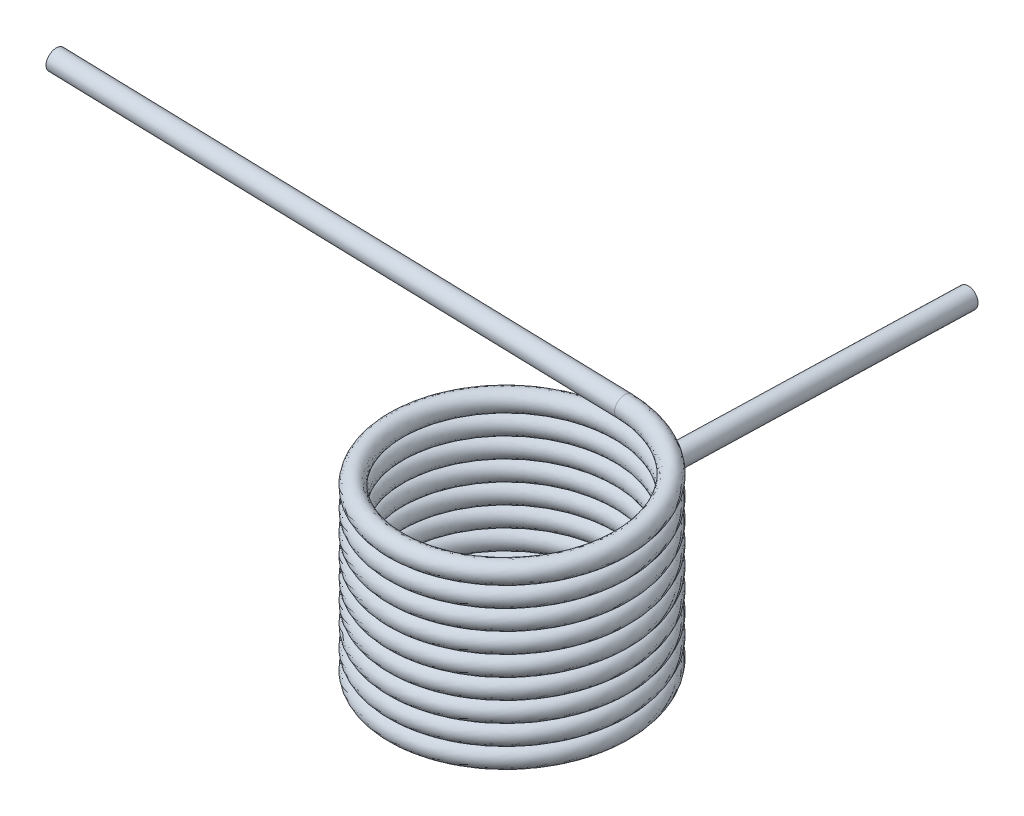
ISO-10303-21;
HEADER;
FILE_DESCRIPTION(('STEP AP214'),'2;1');
FILE_NAME('part.step','',(''),(''),'','','');
FILE_SCHEMA(('AUTOMOTIVE_DESIGN { 1 0 10303 214 1 1 1 1 }'));
ENDSEC;
DATA;
#1=APPLICATION_CONTEXT('core data for automotive mechanical design processes');
#2=APPLICATION_PROTOCOL_DEFINITION('international standard','automotive_design',2000,#1);
#3=PRODUCT_CONTEXT('',#1,'mechanical');
#4=PRODUCT('Part','Part','',(#3));
#5=PRODUCT_RELATED_PRODUCT_CATEGORY('part','',(#4));
#6=PRODUCT_DEFINITION_FORMATION('','',#4);
#7=PRODUCT_DEFINITION_CONTEXT('part definition',#1,'design');
#8=PRODUCT_DEFINITION('design','',#6,#7);
#9=PRODUCT_DEFINITION_SHAPE('','',#8);
#10=(LENGTH_UNIT() NAMED_UNIT(*) SI_UNIT(.MILLI.,.METRE.));
#11=(NAMED_UNIT(*) PLANE_ANGLE_UNIT() SI_UNIT($,.RADIAN.));
#12=(NAMED_UNIT(*) SI_UNIT($,.STERADIAN.) SOLID_ANGLE_UNIT());
#13=UNCERTAINTY_MEASURE_WITH_UNIT(LENGTH_MEASURE(1.E-05),#10,'distance_accuracy_value','');
#14=(GEOMETRIC_REPRESENTATION_CONTEXT(3) GLOBAL_UNCERTAINTY_ASSIGNED_CONTEXT((#13)) GLOBAL_UNIT_ASSIGNED_CONTEXT((#10,
#11,#12)) REPRESENTATION_CONTEXT('',''));
#15=CARTESIAN_POINT('',(0.,0.,0.));
#16=DIRECTION('',(0.,0.,1.));
#17=DIRECTION('',(1.,0.,0.));
#18=AXIS2_PLACEMENT_3D('',#15,#16,#17);
#19=CARTESIAN_POINT('',(-10.0457,-0.88864699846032,0.0250501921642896));
#20=CARTESIAN_POINT('',(-10.0375606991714,-0.79968349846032,3.2890959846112));
#21=CARTESIAN_POINT('',(-8.11241788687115,-0.71071999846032,5.92498034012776));
#22=CARTESIAN_POINT('',(-6.18727507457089,-0.62175649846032,8.56086469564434));
#23=CARTESIAN_POINT('',(-3.08046787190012,-0.53279299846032,9.56176938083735));
#24=CARTESIAN_POINT('',(0.0263393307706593,-0.44382949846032,10.5626740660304));
#25=CARTESIAN_POINT('',(3.1281161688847,-0.35486599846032,9.5462875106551));
#26=CARTESIAN_POINT('',(6.22989300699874,-0.26590249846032,8.52990095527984));
#27=CARTESIAN_POINT('',(8.14186615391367,-0.17693899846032,5.88444827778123));
#28=CARTESIAN_POINT('',(10.0538393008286,-0.0879754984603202,3.23899560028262));
#29=CARTESIAN_POINT('',(10.0457,0.000988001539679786,-0.0250501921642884));
#30=CARTESIAN_POINT('',(10.0375606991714,0.0899515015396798,-3.2890959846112));
#31=CARTESIAN_POINT('',(8.11241788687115,0.17891500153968,-5.92498034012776));
#32=CARTESIAN_POINT('',(6.18727507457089,0.26787850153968,-8.56086469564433));
#33=CARTESIAN_POINT('',(3.08046787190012,0.35684200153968,-9.56176938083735));
#34=CARTESIAN_POINT('',(-0.026339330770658,0.44580550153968,-10.5626740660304));
#35=CARTESIAN_POINT('',(-3.1281161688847,0.53476900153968,-9.5462875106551));
#36=CARTESIAN_POINT('',(-6.22989300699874,0.62373250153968,-8.52990095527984));
#37=CARTESIAN_POINT('',(-8.14186615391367,0.71269600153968,-5.88444827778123));
#38=CARTESIAN_POINT('',(-10.0538393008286,0.80165950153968,-3.23899560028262));
#39=CARTESIAN_POINT('',(-10.0457,0.89062300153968,0.0250501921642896));
#40=CARTESIAN_POINT('',(-10.0375606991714,0.97958650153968,3.2890959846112));
#41=CARTESIAN_POINT('',(-8.11241788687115,1.06855000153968,5.92498034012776));
#42=CARTESIAN_POINT('',(-6.18727507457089,1.15751350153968,8.56086469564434));
#43=CARTESIAN_POINT('',(-3.08046787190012,1.24647700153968,9.56176938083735));
#44=CARTESIAN_POINT('',(0.0263393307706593,1.33544050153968,10.5626740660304));
#45=CARTESIAN_POINT('',(3.1281161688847,1.42440400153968,9.5462875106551));
#46=CARTESIAN_POINT('',(6.22989300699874,1.51336750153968,8.52990095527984));
#47=CARTESIAN_POINT('',(8.14186615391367,1.60233100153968,5.88444827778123));
#48=CARTESIAN_POINT('',(10.0538393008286,1.69129450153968,3.23899560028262));
#49=CARTESIAN_POINT('',(10.0457,1.78025800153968,-0.0250501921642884));
#50=CARTESIAN_POINT('',(10.0375606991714,1.86922150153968,-3.2890959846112));
#51=CARTESIAN_POINT('',(8.11241788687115,1.95818500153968,-5.92498034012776));
#52=CARTESIAN_POINT('',(6.18727507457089,2.04714850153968,-8.56086469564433));
#53=CARTESIAN_POINT('',(3.08046787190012,2.13611200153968,-9.56176938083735));
#54=CARTESIAN_POINT('',(-0.026339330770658,2.22507550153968,-10.5626740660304));
#55=CARTESIAN_POINT('',(-3.1281161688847,2.31403900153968,-9.5462875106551));
#56=CARTESIAN_POINT('',(-6.22989300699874,2.40300250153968,-8.52990095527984));
#57=CARTESIAN_POINT('',(-8.14186615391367,2.49196600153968,-5.88444827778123));
#58=CARTESIAN_POINT('',(-10.0538393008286,2.58092950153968,-3.23899560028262));
#59=CARTESIAN_POINT('',(-10.0457,2.66989300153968,0.0250501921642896));
#60=CARTESIAN_POINT('',(-10.0375606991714,2.75885650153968,3.2890959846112));
#61=CARTESIAN_POINT('',(-8.11241788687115,2.84782000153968,5.92498034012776));
#62=CARTESIAN_POINT('',(-6.18727507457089,2.93678350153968,8.56086469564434));
#63=CARTESIAN_POINT('',(-3.08046787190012,3.02574700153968,9.56176938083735));
#64=CARTESIAN_POINT('',(0.0263393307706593,3.11471050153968,10.5626740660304));
#65=CARTESIAN_POINT('',(3.1281161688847,3.20367400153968,9.5462875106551));
#66=CARTESIAN_POINT('',(6.22989300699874,3.29263750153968,8.52990095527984));
#67=CARTESIAN_POINT('',(8.14186615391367,3.38160100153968,5.88444827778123));
#68=CARTESIAN_POINT('',(10.0538393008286,3.47056450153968,3.23899560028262));
#69=CARTESIAN_POINT('',(10.0457,3.55952800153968,-0.0250501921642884));
#70=CARTESIAN_POINT('',(10.0375606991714,3.64849150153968,-3.2890959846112));
#71=CARTESIAN_POINT('',(8.11241788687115,3.73745500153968,-5.92498034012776));
#72=CARTESIAN_POINT('',(6.18727507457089,3.82641850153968,-8.56086469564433));
#73=CARTESIAN_POINT('',(3.08046787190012,3.91538200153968,-9.56176938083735));
#74=CARTESIAN_POINT('',(-0.026339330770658,4.00434550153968,-10.5626740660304));
#75=CARTESIAN_POINT('',(-3.1281161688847,4.09330900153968,-9.5462875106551));
#76=CARTESIAN_POINT('',(-6.22989300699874,4.18227250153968,-8.52990095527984));
#77=CARTESIAN_POINT('',(-8.14186615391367,4.27123600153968,-5.88444827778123));
#78=CARTESIAN_POINT('',(-10.0538393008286,4.36019950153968,-3.23899560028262));
#79=CARTESIAN_POINT('',(-10.0457,4.44916300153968,0.0250501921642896));
#80=CARTESIAN_POINT('',(-10.0375606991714,4.53812650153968,3.2890959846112));
#81=CARTESIAN_POINT('',(-8.11241788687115,4.62709000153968,5.92498034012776));
#82=CARTESIAN_POINT('',(-6.18727507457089,4.71605350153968,8.56086469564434));
#83=CARTESIAN_POINT('',(-3.08046787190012,4.80501700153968,9.56176938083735));
#84=CARTESIAN_POINT('',(0.0263393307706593,4.89398050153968,10.5626740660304));
#85=CARTESIAN_POINT('',(3.1281161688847,4.98294400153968,9.5462875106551));
#86=CARTESIAN_POINT('',(6.22989300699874,5.07190750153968,8.52990095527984));
#87=CARTESIAN_POINT('',(8.14186615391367,5.16087100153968,5.88444827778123));
#88=CARTESIAN_POINT('',(10.0538393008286,5.24983450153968,3.23899560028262));
#89=CARTESIAN_POINT('',(10.0457,5.33879800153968,-0.0250501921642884));
#90=CARTESIAN_POINT('',(10.0375606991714,5.42776150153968,-3.2890959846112));
#91=CARTESIAN_POINT('',(8.11241788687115,5.51672500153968,-5.92498034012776));
#92=CARTESIAN_POINT('',(6.18727507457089,5.60568850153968,-8.56086469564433));
#93=CARTESIAN_POINT('',(3.08046787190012,5.69465200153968,-9.56176938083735));
#94=CARTESIAN_POINT('',(-0.026339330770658,5.78361550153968,-10.5626740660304));
#95=CARTESIAN_POINT('',(-3.1281161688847,5.87257900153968,-9.5462875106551));
#96=CARTESIAN_POINT('',(-6.22989300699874,5.96154250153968,-8.52990095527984));
#97=CARTESIAN_POINT('',(-8.14186615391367,6.05050600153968,-5.88444827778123));
#98=CARTESIAN_POINT('',(-10.0538393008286,6.13946950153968,-3.23899560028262));
#99=CARTESIAN_POINT('',(-10.0457,6.22843300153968,0.0250501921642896));
#100=CARTESIAN_POINT('',(-10.0375606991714,6.31739650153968,3.2890959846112));
#101=CARTESIAN_POINT('',(-8.11241788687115,6.40636000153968,5.92498034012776));
#102=CARTESIAN_POINT('',(-6.18727507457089,6.49532350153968,8.56086469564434));
#103=CARTESIAN_POINT('',(-3.08046787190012,6.58428700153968,9.56176938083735));
#104=CARTESIAN_POINT('',(0.0263393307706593,6.67325050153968,10.5626740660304));
#105=CARTESIAN_POINT('',(3.1281161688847,6.76221400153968,9.5462875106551));
#106=CARTESIAN_POINT('',(6.22989300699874,6.85117750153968,8.52990095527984));
#107=CARTESIAN_POINT('',(8.14186615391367,6.94014100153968,5.88444827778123));
#108=CARTESIAN_POINT('',(10.0538393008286,7.02910450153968,3.23899560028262));
#109=CARTESIAN_POINT('',(10.0457,7.11806800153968,-0.0250501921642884));
#110=CARTESIAN_POINT('',(10.0375606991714,7.20703150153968,-3.2890959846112));
#111=CARTESIAN_POINT('',(8.11241788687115,7.29599500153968,-5.92498034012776));
#112=CARTESIAN_POINT('',(6.18727507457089,7.38495850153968,-8.56086469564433));
#113=CARTESIAN_POINT('',(3.08046787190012,7.47392200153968,-9.56176938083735));
#114=CARTESIAN_POINT('',(-0.026339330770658,7.56288550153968,-10.5626740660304));
#115=CARTESIAN_POINT('',(-3.1281161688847,7.65184900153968,-9.5462875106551));
#116=CARTESIAN_POINT('',(-6.22989300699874,7.74081250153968,-8.52990095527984));
#117=CARTESIAN_POINT('',(-8.14186615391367,7.82977600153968,-5.88444827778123));
#118=CARTESIAN_POINT('',(-10.0538393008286,7.91873950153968,-3.23899560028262));
#119=CARTESIAN_POINT('',(-10.0457,8.00770300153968,0.0250501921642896));
#120=CARTESIAN_POINT('',(-10.0375606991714,8.09666650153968,3.2890959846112));
#121=CARTESIAN_POINT('',(-8.11241788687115,8.18563000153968,5.92498034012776));
#122=CARTESIAN_POINT('',(-6.18727507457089,8.27459350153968,8.56086469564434));
#123=CARTESIAN_POINT('',(-3.08046787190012,8.36355700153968,9.56176938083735));
#124=CARTESIAN_POINT('',(0.0263393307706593,8.45252050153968,10.5626740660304));
#125=CARTESIAN_POINT('',(3.1281161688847,8.54148400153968,9.5462875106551));
#126=CARTESIAN_POINT('',(6.22989300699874,8.63044750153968,8.52990095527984));
#127=CARTESIAN_POINT('',(8.14186615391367,8.71941100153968,5.88444827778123));
#128=CARTESIAN_POINT('',(10.0538393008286,8.80837450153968,3.23899560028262));
#129=CARTESIAN_POINT('',(10.0457,8.89733800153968,-0.0250501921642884));
#130=CARTESIAN_POINT('',(10.0375606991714,8.98630150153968,-3.2890959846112));
#131=CARTESIAN_POINT('',(8.11241788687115,9.07526500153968,-5.92498034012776));
#132=CARTESIAN_POINT('',(6.18727507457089,9.16422850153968,-8.56086469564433));
#133=CARTESIAN_POINT('',(3.08046787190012,9.25319200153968,-9.56176938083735));
#134=CARTESIAN_POINT('',(-0.026339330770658,9.34215550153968,-10.5626740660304));
#135=CARTESIAN_POINT('',(-3.1281161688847,9.43111900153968,-9.5462875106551));
#136=CARTESIAN_POINT('',(-6.22989300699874,9.52008250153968,-8.52990095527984));
#137=CARTESIAN_POINT('',(-8.14186615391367,9.60904600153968,-5.88444827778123));
#138=CARTESIAN_POINT('',(-10.0538393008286,9.69800950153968,-3.23899560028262));
#139=CARTESIAN_POINT('',(-10.0457,9.78697300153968,0.0250501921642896));
#140=CARTESIAN_POINT('',(-10.0375606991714,9.87593650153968,3.2890959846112));
#141=CARTESIAN_POINT('',(-8.11241788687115,9.96490000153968,5.92498034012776));
#142=CARTESIAN_POINT('',(-6.18727507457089,10.0538635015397,8.56086469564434));
#143=CARTESIAN_POINT('',(-3.08046787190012,10.1428270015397,9.56176938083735));
#144=CARTESIAN_POINT('',(0.0263393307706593,10.2317905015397,10.5626740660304));
#145=CARTESIAN_POINT('',(3.1281161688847,10.3207540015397,9.5462875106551));
#146=CARTESIAN_POINT('',(6.22989300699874,10.4097175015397,8.52990095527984));
#147=CARTESIAN_POINT('',(8.14186615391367,10.4986810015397,5.88444827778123));
#148=CARTESIAN_POINT('',(10.0538393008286,10.5876445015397,3.23899560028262));
#149=CARTESIAN_POINT('',(10.0457,10.6766080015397,-0.0250501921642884));
#150=CARTESIAN_POINT('',(10.0375606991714,10.7655715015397,-3.2890959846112));
#151=CARTESIAN_POINT('',(8.11241788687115,10.8545350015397,-5.92498034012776));
#152=CARTESIAN_POINT('',(6.18727507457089,10.9434985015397,-8.56086469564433));
#153=CARTESIAN_POINT('',(3.08046787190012,11.0324620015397,-9.56176938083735));
#154=CARTESIAN_POINT('',(-0.026339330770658,11.1214255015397,-10.5626740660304));
#155=CARTESIAN_POINT('',(-3.1281161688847,11.2103890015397,-9.5462875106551));
#156=CARTESIAN_POINT('',(-6.22989300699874,11.2993525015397,-8.52990095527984));
#157=CARTESIAN_POINT('',(-8.14186615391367,11.3883160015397,-5.88444827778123));
#158=CARTESIAN_POINT('',(-10.0538393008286,11.4772795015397,-3.23899560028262));
#159=CARTESIAN_POINT('',(-10.0457,11.5662430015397,0.0250501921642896));
#160=CARTESIAN_POINT('',(-10.0375606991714,11.6552065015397,3.2890959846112));
#161=CARTESIAN_POINT('',(-8.11241788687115,11.7441700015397,5.92498034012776));
#162=CARTESIAN_POINT('',(-6.18727507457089,11.8331335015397,8.56086469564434));
#163=CARTESIAN_POINT('',(-3.08046787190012,11.9220970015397,9.56176938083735));
#164=CARTESIAN_POINT('',(0.0263393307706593,12.0110605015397,10.5626740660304));
#165=CARTESIAN_POINT('',(3.1281161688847,12.1000240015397,9.5462875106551));
#166=CARTESIAN_POINT('',(6.22989300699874,12.1889875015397,8.52990095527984));
#167=CARTESIAN_POINT('',(8.14186615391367,12.2779510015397,5.88444827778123));
#168=CARTESIAN_POINT('',(10.0538393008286,12.3669145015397,3.23899560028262));
#169=CARTESIAN_POINT('',(10.0457,12.4558780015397,-0.0250501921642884));
#170=CARTESIAN_POINT('',(10.0375606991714,12.5448415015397,-3.2890959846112));
#171=CARTESIAN_POINT('',(8.11241788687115,12.6338050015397,-5.92498034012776));
#172=CARTESIAN_POINT('',(6.18727507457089,12.7227685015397,-8.56086469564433));
#173=CARTESIAN_POINT('',(3.08046787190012,12.8117320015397,-9.56176938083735));
#174=CARTESIAN_POINT('',(-0.026339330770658,12.9006955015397,-10.5626740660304));
#175=CARTESIAN_POINT('',(-3.1281161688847,12.9896590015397,-9.5462875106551));
#176=CARTESIAN_POINT('',(-6.22989300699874,13.0786225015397,-8.52990095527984));
#177=CARTESIAN_POINT('',(-8.14186615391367,13.1675860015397,-5.88444827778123));
#178=CARTESIAN_POINT('',(-10.0538393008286,13.2565495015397,-3.23899560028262));
#179=CARTESIAN_POINT('',(-10.0457,13.3455130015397,0.0250501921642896));
#180=CARTESIAN_POINT('',(-10.0375606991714,13.4344765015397,3.2890959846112));
#181=CARTESIAN_POINT('',(-8.11241788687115,13.5234400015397,5.92498034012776));
#182=CARTESIAN_POINT('',(-6.18727507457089,13.6124035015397,8.56086469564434));
#183=CARTESIAN_POINT('',(-3.08046787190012,13.7013670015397,9.56176938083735));
#184=CARTESIAN_POINT('',(0.0263393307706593,13.7903305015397,10.5626740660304));
#185=CARTESIAN_POINT('',(3.1281161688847,13.8792940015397,9.5462875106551));
#186=CARTESIAN_POINT('',(6.22989300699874,13.9682575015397,8.52990095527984));
#187=CARTESIAN_POINT('',(8.14186615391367,14.0572210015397,5.88444827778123));
#188=CARTESIAN_POINT('',(10.0538393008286,14.1461845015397,3.23899560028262));
#189=CARTESIAN_POINT('',(10.0457,14.2351480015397,-0.0250501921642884));
#190=CARTESIAN_POINT('',(10.0375606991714,14.3241115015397,-3.2890959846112));
#191=CARTESIAN_POINT('',(8.11241788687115,14.4130750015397,-5.92498034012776));
#192=CARTESIAN_POINT('',(6.18727507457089,14.5020385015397,-8.56086469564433));
#193=CARTESIAN_POINT('',(3.08046787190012,14.5910020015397,-9.56176938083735));
#194=CARTESIAN_POINT('',(1.56603238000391,14.6343678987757,-10.049667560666));
#195=CARTESIAN_POINT('',(-0.0250501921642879,14.6799655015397,-10.0457));
#196=CARTESIAN_POINT('',(-8.2677,-0.888646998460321,0.0250501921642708));
#197=CARTESIAN_POINT('',(-8.25956069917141,-0.799683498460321,2.71138876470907));
#198=CARTESIAN_POINT('',(-6.6739856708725,-0.710719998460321,4.87989816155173));
#199=CARTESIAN_POINT('',(-5.0884106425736,-0.621756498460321,7.0484075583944));
#200=CARTESIAN_POINT('',(-2.53103565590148,-0.532792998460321,7.87079089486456));
#201=CARTESIAN_POINT('',(0.0263393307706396,-0.443829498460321,8.69317423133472));
#202=CARTESIAN_POINT('',(2.57868395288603,-0.354865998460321,7.85530902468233));
#203=CARTESIAN_POINT('',(5.13102857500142,-0.265902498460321,7.01744381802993));
#204=CARTESIAN_POINT('',(6.703433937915,-0.176938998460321,4.83936609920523));
#205=CARTESIAN_POINT('',(8.27583930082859,-0.0879754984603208,2.66128838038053));
#206=CARTESIAN_POINT('',(8.2677,0.000988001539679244,-0.0250501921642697));
#207=CARTESIAN_POINT('',(8.25956069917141,0.0899515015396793,-2.71138876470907));
#208=CARTESIAN_POINT('',(6.6739856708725,0.178915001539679,-4.87989816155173));
#209=CARTESIAN_POINT('',(5.0884106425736,0.267878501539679,-7.0484075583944));
#210=CARTESIAN_POINT('',(2.53103565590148,0.356842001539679,-7.87079089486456));
#211=CARTESIAN_POINT('',(-0.0263393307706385,0.445805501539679,-8.69317423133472));
#212=CARTESIAN_POINT('',(-2.57868395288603,0.534769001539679,-7.85530902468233));
#213=CARTESIAN_POINT('',(-5.13102857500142,0.623732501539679,-7.01744381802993));
#214=CARTESIAN_POINT('',(-6.703433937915,0.712696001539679,-4.83936609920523));
#215=CARTESIAN_POINT('',(-8.27583930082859,0.801659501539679,-2.66128838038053));
#216=CARTESIAN_POINT('',(-8.2677,0.890623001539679,0.0250501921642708));
#217=CARTESIAN_POINT('',(-8.25956069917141,0.979586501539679,2.71138876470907));
#218=CARTESIAN_POINT('',(-6.6739856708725,1.06855000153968,4.87989816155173));
#219=CARTESIAN_POINT('',(-5.0884106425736,1.15751350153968,7.0484075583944));
#220=CARTESIAN_POINT('',(-2.53103565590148,1.24647700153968,7.87079089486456));
#221=CARTESIAN_POINT('',(0.0263393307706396,1.33544050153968,8.69317423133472));
#222=CARTESIAN_POINT('',(2.57868395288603,1.42440400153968,7.85530902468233));
#223=CARTESIAN_POINT('',(5.13102857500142,1.51336750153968,7.01744381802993));
#224=CARTESIAN_POINT('',(6.703433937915,1.60233100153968,4.83936609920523));
#225=CARTESIAN_POINT('',(8.27583930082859,1.69129450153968,2.66128838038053));
#226=CARTESIAN_POINT('',(8.2677,1.78025800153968,-0.0250501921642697));
#227=CARTESIAN_POINT('',(8.25956069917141,1.86922150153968,-2.71138876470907));
#228=CARTESIAN_POINT('',(6.6739856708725,1.95818500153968,-4.87989816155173));
#229=CARTESIAN_POINT('',(5.0884106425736,2.04714850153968,-7.0484075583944));
#230=CARTESIAN_POINT('',(2.53103565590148,2.13611200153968,-7.87079089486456));
#231=CARTESIAN_POINT('',(-0.0263393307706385,2.22507550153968,-8.69317423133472));
#232=CARTESIAN_POINT('',(-2.57868395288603,2.31403900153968,-7.85530902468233));
#233=CARTESIAN_POINT('',(-5.13102857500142,2.40300250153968,-7.01744381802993));
#234=CARTESIAN_POINT('',(-6.703433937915,2.49196600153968,-4.83936609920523));
#235=CARTESIAN_POINT('',(-8.27583930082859,2.58092950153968,-2.66128838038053));
#236=CARTESIAN_POINT('',(-8.2677,2.66989300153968,0.0250501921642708));
#237=CARTESIAN_POINT('',(-8.25956069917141,2.75885650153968,2.71138876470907));
#238=CARTESIAN_POINT('',(-6.6739856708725,2.84782000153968,4.87989816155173));
#239=CARTESIAN_POINT('',(-5.0884106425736,2.93678350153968,7.0484075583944));
#240=CARTESIAN_POINT('',(-2.53103565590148,3.02574700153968,7.87079089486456));
#241=CARTESIAN_POINT('',(0.0263393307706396,3.11471050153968,8.69317423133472));
#242=CARTESIAN_POINT('',(2.57868395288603,3.20367400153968,7.85530902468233));
#243=CARTESIAN_POINT('',(5.13102857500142,3.29263750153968,7.01744381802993));
#244=CARTESIAN_POINT('',(6.703433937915,3.38160100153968,4.83936609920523));
#245=CARTESIAN_POINT('',(8.27583930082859,3.47056450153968,2.66128838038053));
#246=CARTESIAN_POINT('',(8.2677,3.55952800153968,-0.0250501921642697));
#247=CARTESIAN_POINT('',(8.25956069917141,3.64849150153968,-2.71138876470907));
#248=CARTESIAN_POINT('',(6.6739856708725,3.73745500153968,-4.87989816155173));
#249=CARTESIAN_POINT('',(5.0884106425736,3.82641850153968,-7.0484075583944));
#250=CARTESIAN_POINT('',(2.53103565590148,3.91538200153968,-7.87079089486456));
#251=CARTESIAN_POINT('',(-0.0263393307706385,4.00434550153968,-8.69317423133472));
#252=CARTESIAN_POINT('',(-2.57868395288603,4.09330900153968,-7.85530902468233));
#253=CARTESIAN_POINT('',(-5.13102857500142,4.18227250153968,-7.01744381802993));
#254=CARTESIAN_POINT('',(-6.703433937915,4.27123600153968,-4.83936609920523));
#255=CARTESIAN_POINT('',(-8.27583930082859,4.36019950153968,-2.66128838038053));
#256=CARTESIAN_POINT('',(-8.2677,4.44916300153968,0.0250501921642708));
#257=CARTESIAN_POINT('',(-8.25956069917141,4.53812650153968,2.71138876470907));
#258=CARTESIAN_POINT('',(-6.6739856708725,4.62709000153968,4.87989816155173));
#259=CARTESIAN_POINT('',(-5.0884106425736,4.71605350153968,7.0484075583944));
#260=CARTESIAN_POINT('',(-2.53103565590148,4.80501700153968,7.87079089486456));
#261=CARTESIAN_POINT('',(0.0263393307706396,4.89398050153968,8.69317423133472));
#262=CARTESIAN_POINT('',(2.57868395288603,4.98294400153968,7.85530902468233));
#263=CARTESIAN_POINT('',(5.13102857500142,5.07190750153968,7.01744381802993));
#264=CARTESIAN_POINT('',(6.703433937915,5.16087100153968,4.83936609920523));
#265=CARTESIAN_POINT('',(8.27583930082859,5.24983450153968,2.66128838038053));
#266=CARTESIAN_POINT('',(8.2677,5.33879800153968,-0.0250501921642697));
#267=CARTESIAN_POINT('',(8.25956069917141,5.42776150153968,-2.71138876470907));
#268=CARTESIAN_POINT('',(6.6739856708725,5.51672500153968,-4.87989816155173));
#269=CARTESIAN_POINT('',(5.0884106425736,5.60568850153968,-7.0484075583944));
#270=CARTESIAN_POINT('',(2.53103565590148,5.69465200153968,-7.87079089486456));
#271=CARTESIAN_POINT('',(-0.0263393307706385,5.78361550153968,-8.69317423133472));
#272=CARTESIAN_POINT('',(-2.57868395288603,5.87257900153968,-7.85530902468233));
#273=CARTESIAN_POINT('',(-5.13102857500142,5.96154250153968,-7.01744381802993));
#274=CARTESIAN_POINT('',(-6.703433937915,6.05050600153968,-4.83936609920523));
#275=CARTESIAN_POINT('',(-8.27583930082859,6.13946950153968,-2.66128838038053));
#276=CARTESIAN_POINT('',(-8.2677,6.22843300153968,0.0250501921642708));
#277=CARTESIAN_POINT('',(-8.25956069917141,6.31739650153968,2.71138876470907));
#278=CARTESIAN_POINT('',(-6.6739856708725,6.40636000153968,4.87989816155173));
#279=CARTESIAN_POINT('',(-5.0884106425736,6.49532350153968,7.0484075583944));
#280=CARTESIAN_POINT('',(-2.53103565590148,6.58428700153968,7.87079089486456));
#281=CARTESIAN_POINT('',(0.0263393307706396,6.67325050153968,8.69317423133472));
#282=CARTESIAN_POINT('',(2.57868395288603,6.76221400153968,7.85530902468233));
#283=CARTESIAN_POINT('',(5.13102857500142,6.85117750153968,7.01744381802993));
#284=CARTESIAN_POINT('',(6.703433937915,6.94014100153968,4.83936609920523));
#285=CARTESIAN_POINT('',(8.27583930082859,7.02910450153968,2.66128838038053));
#286=CARTESIAN_POINT('',(8.2677,7.11806800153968,-0.0250501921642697));
#287=CARTESIAN_POINT('',(8.25956069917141,7.20703150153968,-2.71138876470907));
#288=CARTESIAN_POINT('',(6.6739856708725,7.29599500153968,-4.87989816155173));
#289=CARTESIAN_POINT('',(5.0884106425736,7.38495850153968,-7.0484075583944));
#290=CARTESIAN_POINT('',(2.53103565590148,7.47392200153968,-7.87079089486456));
#291=CARTESIAN_POINT('',(-0.0263393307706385,7.56288550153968,-8.69317423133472));
#292=CARTESIAN_POINT('',(-2.57868395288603,7.65184900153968,-7.85530902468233));
#293=CARTESIAN_POINT('',(-5.13102857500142,7.74081250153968,-7.01744381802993));
#294=CARTESIAN_POINT('',(-6.703433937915,7.82977600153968,-4.83936609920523));
#295=CARTESIAN_POINT('',(-8.27583930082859,7.91873950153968,-2.66128838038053));
#296=CARTESIAN_POINT('',(-8.2677,8.00770300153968,0.0250501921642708));
#297=CARTESIAN_POINT('',(-8.25956069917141,8.09666650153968,2.71138876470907));
#298=CARTESIAN_POINT('',(-6.6739856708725,8.18563000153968,4.87989816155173));
#299=CARTESIAN_POINT('',(-5.0884106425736,8.27459350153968,7.0484075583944));
#300=CARTESIAN_POINT('',(-2.53103565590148,8.36355700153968,7.87079089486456));
#301=CARTESIAN_POINT('',(0.0263393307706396,8.45252050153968,8.69317423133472));
#302=CARTESIAN_POINT('',(2.57868395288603,8.54148400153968,7.85530902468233));
#303=CARTESIAN_POINT('',(5.13102857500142,8.63044750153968,7.01744381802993));
#304=CARTESIAN_POINT('',(6.703433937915,8.71941100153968,4.83936609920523));
#305=CARTESIAN_POINT('',(8.27583930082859,8.80837450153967,2.66128838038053));
#306=CARTESIAN_POINT('',(8.2677,8.89733800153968,-0.0250501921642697));
#307=CARTESIAN_POINT('',(8.25956069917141,8.98630150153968,-2.71138876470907));
#308=CARTESIAN_POINT('',(6.6739856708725,9.07526500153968,-4.87989816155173));
#309=CARTESIAN_POINT('',(5.0884106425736,9.16422850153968,-7.0484075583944));
#310=CARTESIAN_POINT('',(2.53103565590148,9.25319200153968,-7.87079089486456));
#311=CARTESIAN_POINT('',(-0.0263393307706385,9.34215550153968,-8.69317423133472));
#312=CARTESIAN_POINT('',(-2.57868395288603,9.43111900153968,-7.85530902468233));
#313=CARTESIAN_POINT('',(-5.13102857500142,9.52008250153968,-7.01744381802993));
#314=CARTESIAN_POINT('',(-6.703433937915,9.60904600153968,-4.83936609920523));
#315=CARTESIAN_POINT('',(-8.27583930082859,9.69800950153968,-2.66128838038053));
#316=CARTESIAN_POINT('',(-8.2677,9.78697300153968,0.0250501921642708));
#317=CARTESIAN_POINT('',(-8.25956069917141,9.87593650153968,2.71138876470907));
#318=CARTESIAN_POINT('',(-6.6739856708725,9.96490000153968,4.87989816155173));
#319=CARTESIAN_POINT('',(-5.0884106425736,10.0538635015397,7.0484075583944));
#320=CARTESIAN_POINT('',(-2.53103565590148,10.1428270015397,7.87079089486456));
#321=CARTESIAN_POINT('',(0.0263393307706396,10.2317905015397,8.69317423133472));
#322=CARTESIAN_POINT('',(2.57868395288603,10.3207540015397,7.85530902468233));
#323=CARTESIAN_POINT('',(5.13102857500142,10.4097175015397,7.01744381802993));
#324=CARTESIAN_POINT('',(6.703433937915,10.4986810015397,4.83936609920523));
#325=CARTESIAN_POINT('',(8.27583930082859,10.5876445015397,2.66128838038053));
#326=CARTESIAN_POINT('',(8.2677,10.6766080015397,-0.0250501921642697));
#327=CARTESIAN_POINT('',(8.25956069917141,10.7655715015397,-2.71138876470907));
#328=CARTESIAN_POINT('',(6.6739856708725,10.8545350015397,-4.87989816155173));
#329=CARTESIAN_POINT('',(5.0884106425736,10.9434985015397,-7.0484075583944));
#330=CARTESIAN_POINT('',(2.53103565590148,11.0324620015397,-7.87079089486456));
#331=CARTESIAN_POINT('',(-0.0263393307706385,11.1214255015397,-8.69317423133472));
#332=CARTESIAN_POINT('',(-2.57868395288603,11.2103890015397,-7.85530902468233));
#333=CARTESIAN_POINT('',(-5.13102857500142,11.2993525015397,-7.01744381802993));
#334=CARTESIAN_POINT('',(-6.703433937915,11.3883160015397,-4.83936609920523));
#335=CARTESIAN_POINT('',(-8.27583930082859,11.4772795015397,-2.66128838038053));
#336=CARTESIAN_POINT('',(-8.2677,11.5662430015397,0.0250501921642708));
#337=CARTESIAN_POINT('',(-8.25956069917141,11.6552065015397,2.71138876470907));
#338=CARTESIAN_POINT('',(-6.6739856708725,11.7441700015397,4.87989816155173));
#339=CARTESIAN_POINT('',(-5.0884106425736,11.8331335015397,7.0484075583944));
#340=CARTESIAN_POINT('',(-2.53103565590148,11.9220970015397,7.87079089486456));
#341=CARTESIAN_POINT('',(0.0263393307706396,12.0110605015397,8.69317423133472));
#342=CARTESIAN_POINT('',(2.57868395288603,12.1000240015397,7.85530902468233));
#343=CARTESIAN_POINT('',(5.13102857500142,12.1889875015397,7.01744381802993));
#344=CARTESIAN_POINT('',(6.703433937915,12.2779510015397,4.83936609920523));
#345=CARTESIAN_POINT('',(8.27583930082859,12.3669145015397,2.66128838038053));
#346=CARTESIAN_POINT('',(8.2677,12.4558780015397,-0.0250501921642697));
#347=CARTESIAN_POINT('',(8.25956069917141,12.5448415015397,-2.71138876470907));
#348=CARTESIAN_POINT('',(6.6739856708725,12.6338050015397,-4.87989816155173));
#349=CARTESIAN_POINT('',(5.0884106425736,12.7227685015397,-7.0484075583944));
#350=CARTESIAN_POINT('',(2.53103565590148,12.8117320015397,-7.87079089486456));
#351=CARTESIAN_POINT('',(-0.0263393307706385,12.9006955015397,-8.69317423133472));
#352=CARTESIAN_POINT('',(-2.57868395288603,12.9896590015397,-7.85530902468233));
#353=CARTESIAN_POINT('',(-5.13102857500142,13.0786225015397,-7.01744381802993));
#354=CARTESIAN_POINT('',(-6.703433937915,13.1675860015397,-4.83936609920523));
#355=CARTESIAN_POINT('',(-8.27583930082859,13.2565495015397,-2.66128838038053));
#356=CARTESIAN_POINT('',(-8.2677,13.3455130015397,0.0250501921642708));
#357=CARTESIAN_POINT('',(-8.25956069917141,13.4344765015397,2.71138876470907));
#358=CARTESIAN_POINT('',(-6.6739856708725,13.5234400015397,4.87989816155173));
#359=CARTESIAN_POINT('',(-5.0884106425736,13.6124035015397,7.0484075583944));
#360=CARTESIAN_POINT('',(-2.53103565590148,13.7013670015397,7.87079089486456));
#361=CARTESIAN_POINT('',(0.0263393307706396,13.7903305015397,8.69317423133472));
#362=CARTESIAN_POINT('',(2.57868395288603,13.8792940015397,7.85530902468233));
#363=CARTESIAN_POINT('',(5.13102857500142,13.9682575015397,7.01744381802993));
#364=CARTESIAN_POINT('',(6.703433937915,14.0572210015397,4.83936609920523));
#365=CARTESIAN_POINT('',(8.27583930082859,14.1461845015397,2.66128838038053));
#366=CARTESIAN_POINT('',(8.2677,14.2351480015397,-0.0250501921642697));
#367=CARTESIAN_POINT('',(8.25956069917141,14.3241115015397,-2.71138876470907));
#368=CARTESIAN_POINT('',(6.6739856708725,14.4130750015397,-4.87989816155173));
#369=CARTESIAN_POINT('',(5.0884106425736,14.5020385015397,-7.0484075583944));
#370=CARTESIAN_POINT('',(2.53103565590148,14.5910020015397,-7.87079089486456));
#371=CARTESIAN_POINT('',(1.2844248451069,14.6343678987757,-8.27166756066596));
#372=CARTESIAN_POINT('',(-0.0250501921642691,14.6799655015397,-8.2677));
#373=CARTESIAN_POINT('',(-8.2677,0.888646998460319,-0.025050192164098));
#374=CARTESIAN_POINT('',(-8.27583930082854,0.977610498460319,2.6612883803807));
#375=CARTESIAN_POINT('',(-6.7034339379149,1.06657399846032,4.83936609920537));
#376=CARTESIAN_POINT('',(-5.13102857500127,1.15553749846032,7.01744381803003));
#377=CARTESIAN_POINT('',(-2.57868395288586,1.24450099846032,7.85530902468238));
#378=CARTESIAN_POINT('',(-0.0263393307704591,1.33346449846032,8.69317423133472));
#379=CARTESIAN_POINT('',(2.53103565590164,1.42242799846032,7.87079089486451));
#380=CARTESIAN_POINT('',(5.08841064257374,1.51139149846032,7.04840755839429));
#381=CARTESIAN_POINT('',(6.6739856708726,1.60035499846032,4.8798981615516));
#382=CARTESIAN_POINT('',(8.25956069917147,1.68931849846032,2.7113887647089));
#383=CARTESIAN_POINT('',(8.2677,1.77828199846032,0.0250501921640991));
#384=CARTESIAN_POINT('',(8.27583930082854,1.86724549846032,-2.6612883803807));
#385=CARTESIAN_POINT('',(6.7034339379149,1.95620899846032,-4.83936609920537));
#386=CARTESIAN_POINT('',(5.13102857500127,2.04517249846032,-7.01744381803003));
#387=CARTESIAN_POINT('',(2.57868395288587,2.13413599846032,-7.85530902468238));
#388=CARTESIAN_POINT('',(0.0263393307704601,2.22309949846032,-8.69317423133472));
#389=CARTESIAN_POINT('',(-2.53103565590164,2.31206299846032,-7.87079089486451));
#390=CARTESIAN_POINT('',(-5.08841064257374,2.40102649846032,-7.04840755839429));
#391=CARTESIAN_POINT('',(-6.6739856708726,2.48998999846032,-4.8798981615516));
#392=CARTESIAN_POINT('',(-8.25956069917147,2.57895349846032,-2.7113887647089));
#393=CARTESIAN_POINT('',(-8.2677,2.66791699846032,-0.025050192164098));
#394=CARTESIAN_POINT('',(-8.27583930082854,2.75688049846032,2.6612883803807));
#395=CARTESIAN_POINT('',(-6.7034339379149,2.84584399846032,4.83936609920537));
#396=CARTESIAN_POINT('',(-5.13102857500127,2.93480749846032,7.01744381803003));
#397=CARTESIAN_POINT('',(-2.57868395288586,3.02377099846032,7.85530902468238));
#398=CARTESIAN_POINT('',(-0.0263393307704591,3.11273449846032,8.69317423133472));
#399=CARTESIAN_POINT('',(2.53103565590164,3.20169799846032,7.87079089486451));
#400=CARTESIAN_POINT('',(5.08841064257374,3.29066149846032,7.04840755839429));
#401=CARTESIAN_POINT('',(6.6739856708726,3.37962499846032,4.8798981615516));
#402=CARTESIAN_POINT('',(8.25956069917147,3.46858849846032,2.7113887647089));
#403=CARTESIAN_POINT('',(8.2677,3.55755199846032,0.0250501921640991));
#404=CARTESIAN_POINT('',(8.27583930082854,3.64651549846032,-2.6612883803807));
#405=CARTESIAN_POINT('',(6.7034339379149,3.73547899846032,-4.83936609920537));
#406=CARTESIAN_POINT('',(5.13102857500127,3.82444249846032,-7.01744381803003));
#407=CARTESIAN_POINT('',(2.57868395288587,3.91340599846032,-7.85530902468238));
#408=CARTESIAN_POINT('',(0.0263393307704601,4.00236949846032,-8.69317423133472));
#409=CARTESIAN_POINT('',(-2.53103565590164,4.09133299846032,-7.87079089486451));
#410=CARTESIAN_POINT('',(-5.08841064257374,4.18029649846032,-7.04840755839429));
#411=CARTESIAN_POINT('',(-6.6739856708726,4.26925999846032,-4.8798981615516));
#412=CARTESIAN_POINT('',(-8.25956069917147,4.35822349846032,-2.7113887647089));
#413=CARTESIAN_POINT('',(-8.2677,4.44718699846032,-0.025050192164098));
#414=CARTESIAN_POINT('',(-8.27583930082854,4.53615049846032,2.6612883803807));
#415=CARTESIAN_POINT('',(-6.7034339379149,4.62511399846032,4.83936609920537));
#416=CARTESIAN_POINT('',(-5.13102857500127,4.71407749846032,7.01744381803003));
#417=CARTESIAN_POINT('',(-2.57868395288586,4.80304099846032,7.85530902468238));
#418=CARTESIAN_POINT('',(-0.0263393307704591,4.89200449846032,8.69317423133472));
#419=CARTESIAN_POINT('',(2.53103565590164,4.98096799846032,7.87079089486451));
#420=CARTESIAN_POINT('',(5.08841064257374,5.06993149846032,7.04840755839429));
#421=CARTESIAN_POINT('',(6.6739856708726,5.15889499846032,4.8798981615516));
#422=CARTESIAN_POINT('',(8.25956069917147,5.24785849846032,2.7113887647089));
#423=CARTESIAN_POINT('',(8.2677,5.33682199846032,0.0250501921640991));
#424=CARTESIAN_POINT('',(8.27583930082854,5.42578549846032,-2.6612883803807));
#425=CARTESIAN_POINT('',(6.7034339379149,5.51474899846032,-4.83936609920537));
#426=CARTESIAN_POINT('',(5.13102857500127,5.60371249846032,-7.01744381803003));
#427=CARTESIAN_POINT('',(2.57868395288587,5.69267599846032,-7.85530902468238));
#428=CARTESIAN_POINT('',(0.0263393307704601,5.78163949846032,-8.69317423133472));
#429=CARTESIAN_POINT('',(-2.53103565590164,5.87060299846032,-7.87079089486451));
#430=CARTESIAN_POINT('',(-5.08841064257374,5.95956649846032,-7.04840755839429));
#431=CARTESIAN_POINT('',(-6.6739856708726,6.04852999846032,-4.8798981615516));
#432=CARTESIAN_POINT('',(-8.25956069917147,6.13749349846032,-2.7113887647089));
#433=CARTESIAN_POINT('',(-8.2677,6.22645699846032,-0.025050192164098));
#434=CARTESIAN_POINT('',(-8.27583930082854,6.31542049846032,2.6612883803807));
#435=CARTESIAN_POINT('',(-6.7034339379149,6.40438399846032,4.83936609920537));
#436=CARTESIAN_POINT('',(-5.13102857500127,6.49334749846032,7.01744381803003));
#437=CARTESIAN_POINT('',(-2.57868395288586,6.58231099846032,7.85530902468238));
#438=CARTESIAN_POINT('',(-0.0263393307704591,6.67127449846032,8.69317423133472));
#439=CARTESIAN_POINT('',(2.53103565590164,6.76023799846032,7.87079089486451));
#440=CARTESIAN_POINT('',(5.08841064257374,6.84920149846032,7.04840755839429));
#441=CARTESIAN_POINT('',(6.6739856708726,6.93816499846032,4.8798981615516));
#442=CARTESIAN_POINT('',(8.25956069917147,7.02712849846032,2.7113887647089));
#443=CARTESIAN_POINT('',(8.2677,7.11609199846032,0.0250501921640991));
#444=CARTESIAN_POINT('',(8.27583930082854,7.20505549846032,-2.6612883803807));
#445=CARTESIAN_POINT('',(6.7034339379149,7.29401899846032,-4.83936609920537));
#446=CARTESIAN_POINT('',(5.13102857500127,7.38298249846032,-7.01744381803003));
#447=CARTESIAN_POINT('',(2.57868395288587,7.47194599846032,-7.85530902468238));
#448=CARTESIAN_POINT('',(0.0263393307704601,7.56090949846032,-8.69317423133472));
#449=CARTESIAN_POINT('',(-2.53103565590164,7.64987299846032,-7.87079089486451));
#450=CARTESIAN_POINT('',(-5.08841064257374,7.73883649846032,-7.04840755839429));
#451=CARTESIAN_POINT('',(-6.6739856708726,7.82779999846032,-4.8798981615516));
#452=CARTESIAN_POINT('',(-8.25956069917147,7.91676349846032,-2.7113887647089));
#453=CARTESIAN_POINT('',(-8.2677,8.00572699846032,-0.025050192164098));
#454=CARTESIAN_POINT('',(-8.27583930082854,8.09469049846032,2.6612883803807));
#455=CARTESIAN_POINT('',(-6.7034339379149,8.18365399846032,4.83936609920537));
#456=CARTESIAN_POINT('',(-5.13102857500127,8.27261749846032,7.01744381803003));
#457=CARTESIAN_POINT('',(-2.57868395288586,8.36158099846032,7.85530902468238));
#458=CARTESIAN_POINT('',(-0.0263393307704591,8.45054449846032,8.69317423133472));
#459=CARTESIAN_POINT('',(2.53103565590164,8.53950799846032,7.87079089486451));
#460=CARTESIAN_POINT('',(5.08841064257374,8.62847149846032,7.04840755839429));
#461=CARTESIAN_POINT('',(6.6739856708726,8.71743499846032,4.8798981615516));
#462=CARTESIAN_POINT('',(8.25956069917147,8.80639849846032,2.7113887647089));
#463=CARTESIAN_POINT('',(8.2677,8.89536199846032,0.0250501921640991));
#464=CARTESIAN_POINT('',(8.27583930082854,8.98432549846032,-2.6612883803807));
#465=CARTESIAN_POINT('',(6.7034339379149,9.07328899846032,-4.83936609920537));
#466=CARTESIAN_POINT('',(5.13102857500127,9.16225249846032,-7.01744381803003));
#467=CARTESIAN_POINT('',(2.57868395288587,9.25121599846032,-7.85530902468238));
#468=CARTESIAN_POINT('',(0.0263393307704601,9.34017949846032,-8.69317423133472));
#469=CARTESIAN_POINT('',(-2.53103565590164,9.42914299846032,-7.87079089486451));
#470=CARTESIAN_POINT('',(-5.08841064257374,9.51810649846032,-7.04840755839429));
#471=CARTESIAN_POINT('',(-6.6739856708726,9.60706999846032,-4.8798981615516));
#472=CARTESIAN_POINT('',(-8.25956069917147,9.69603349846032,-2.7113887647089));
#473=CARTESIAN_POINT('',(-8.2677,9.78499699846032,-0.025050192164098));
#474=CARTESIAN_POINT('',(-8.27583930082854,9.87396049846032,2.6612883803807));
#475=CARTESIAN_POINT('',(-6.7034339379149,9.96292399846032,4.83936609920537));
#476=CARTESIAN_POINT('',(-5.13102857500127,10.0518874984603,7.01744381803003));
#477=CARTESIAN_POINT('',(-2.57868395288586,10.1408509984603,7.85530902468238));
#478=CARTESIAN_POINT('',(-0.0263393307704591,10.2298144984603,8.69317423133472));
#479=CARTESIAN_POINT('',(2.53103565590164,10.3187779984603,7.87079089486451));
#480=CARTESIAN_POINT('',(5.08841064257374,10.4077414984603,7.04840755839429));
#481=CARTESIAN_POINT('',(6.6739856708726,10.4967049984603,4.8798981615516));
#482=CARTESIAN_POINT('',(8.25956069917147,10.5856684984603,2.7113887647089));
#483=CARTESIAN_POINT('',(8.2677,10.6746319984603,0.0250501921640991));
#484=CARTESIAN_POINT('',(8.27583930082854,10.7635954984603,-2.6612883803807));
#485=CARTESIAN_POINT('',(6.7034339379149,10.8525589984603,-4.83936609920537));
#486=CARTESIAN_POINT('',(5.13102857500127,10.9415224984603,-7.01744381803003));
#487=CARTESIAN_POINT('',(2.57868395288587,11.0304859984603,-7.85530902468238));
#488=CARTESIAN_POINT('',(0.0263393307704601,11.1194494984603,-8.69317423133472));
#489=CARTESIAN_POINT('',(-2.53103565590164,11.2084129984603,-7.87079089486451));
#490=CARTESIAN_POINT('',(-5.08841064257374,11.2973764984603,-7.04840755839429));
#491=CARTESIAN_POINT('',(-6.6739856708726,11.3863399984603,-4.8798981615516));
#492=CARTESIAN_POINT('',(-8.25956069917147,11.4753034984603,-2.7113887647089));
#493=CARTESIAN_POINT('',(-8.2677,11.5642669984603,-0.025050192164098));
#494=CARTESIAN_POINT('',(-8.27583930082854,11.6532304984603,2.6612883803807));
#495=CARTESIAN_POINT('',(-6.7034339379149,11.7421939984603,4.83936609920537));
#496=CARTESIAN_POINT('',(-5.13102857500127,11.8311574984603,7.01744381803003));
#497=CARTESIAN_POINT('',(-2.57868395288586,11.9201209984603,7.85530902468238));
#498=CARTESIAN_POINT('',(-0.0263393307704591,12.0090844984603,8.69317423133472));
#499=CARTESIAN_POINT('',(2.53103565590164,12.0980479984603,7.87079089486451));
#500=CARTESIAN_POINT('',(5.08841064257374,12.1870114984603,7.04840755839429));
#501=CARTESIAN_POINT('',(6.6739856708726,12.2759749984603,4.8798981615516));
#502=CARTESIAN_POINT('',(8.25956069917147,12.3649384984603,2.7113887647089));
#503=CARTESIAN_POINT('',(8.2677,12.4539019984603,0.0250501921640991));
#504=CARTESIAN_POINT('',(8.27583930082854,12.5428654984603,-2.6612883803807));
#505=CARTESIAN_POINT('',(6.7034339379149,12.6318289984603,-4.83936609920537));
#506=CARTESIAN_POINT('',(5.13102857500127,12.7207924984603,-7.01744381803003));
#507=CARTESIAN_POINT('',(2.57868395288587,12.8097559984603,-7.85530902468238));
#508=CARTESIAN_POINT('',(0.0263393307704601,12.8987194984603,-8.69317423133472));
#509=CARTESIAN_POINT('',(-2.53103565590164,12.9876829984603,-7.87079089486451));
#510=CARTESIAN_POINT('',(-5.08841064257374,13.0766464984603,-7.04840755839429));
#511=CARTESIAN_POINT('',(-6.6739856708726,13.1656099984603,-4.8798981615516));
#512=CARTESIAN_POINT('',(-8.25956069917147,13.2545734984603,-2.7113887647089));
#513=CARTESIAN_POINT('',(-8.2677,13.3435369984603,-0.025050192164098));
#514=CARTESIAN_POINT('',(-8.27583930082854,13.4325004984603,2.6612883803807));
#515=CARTESIAN_POINT('',(-6.7034339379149,13.5214639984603,4.83936609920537));
#516=CARTESIAN_POINT('',(-5.13102857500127,13.6104274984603,7.01744381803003));
#517=CARTESIAN_POINT('',(-2.57868395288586,13.6993909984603,7.85530902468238));
#518=CARTESIAN_POINT('',(-0.0263393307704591,13.7883544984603,8.69317423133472));
#519=CARTESIAN_POINT('',(2.53103565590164,13.8773179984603,7.87079089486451));
#520=CARTESIAN_POINT('',(5.08841064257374,13.9662814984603,7.04840755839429));
#521=CARTESIAN_POINT('',(6.6739856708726,14.0552449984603,4.8798981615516));
#522=CARTESIAN_POINT('',(8.25956069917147,14.1442084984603,2.7113887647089));
#523=CARTESIAN_POINT('',(8.2677,14.2331719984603,0.0250501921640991));
#524=CARTESIAN_POINT('',(8.27583930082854,14.3221354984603,-2.6612883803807));
#525=CARTESIAN_POINT('',(6.7034339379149,14.4110989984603,-4.83936609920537));
#526=CARTESIAN_POINT('',(5.13102857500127,14.5000624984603,-7.01744381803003));
#527=CARTESIAN_POINT('',(2.57868395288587,14.5890259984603,-7.85530902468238));
#528=CARTESIAN_POINT('',(0.0263393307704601,14.6779894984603,-8.69317423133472));
#529=CARTESIAN_POINT('',(-2.53103565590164,14.7669529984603,-7.87079089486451));
#530=CARTESIAN_POINT('',(-5.08841064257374,14.8559164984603,-7.04840755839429));
#531=CARTESIAN_POINT('',(-6.6739856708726,14.9448799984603,-4.8798981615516));
#532=CARTESIAN_POINT('',(-8.25956069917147,15.0338434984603,-2.7113887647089));
#533=CARTESIAN_POINT('',(-8.2677,15.1228069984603,-0.025050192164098));
#534=CARTESIAN_POINT('',(-8.27583930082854,15.2117704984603,2.6612883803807));
#535=CARTESIAN_POINT('',(-6.7034339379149,15.3007339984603,4.83936609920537));
#536=CARTESIAN_POINT('',(-5.13102857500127,15.3896974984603,7.01744381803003));
#537=CARTESIAN_POINT('',(-2.57868395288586,15.4786609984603,7.85530902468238));
#538=CARTESIAN_POINT('',(-0.0263393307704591,15.5676244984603,8.69317423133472));
#539=CARTESIAN_POINT('',(2.53103565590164,15.6565879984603,7.87079089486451));
#540=CARTESIAN_POINT('',(5.08841064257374,15.7455514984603,7.04840755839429));
#541=CARTESIAN_POINT('',(6.6739856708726,15.8345149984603,4.8798981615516));
#542=CARTESIAN_POINT('',(8.25956069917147,15.9234784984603,2.7113887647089));
#543=CARTESIAN_POINT('',(8.2677,16.0124419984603,0.0250501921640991));
#544=CARTESIAN_POINT('',(8.27583930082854,16.1014054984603,-2.6612883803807));
#545=CARTESIAN_POINT('',(6.7034339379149,16.1903689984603,-4.83936609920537));
#546=CARTESIAN_POINT('',(5.13102857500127,16.2793324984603,-7.01744381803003));
#547=CARTESIAN_POINT('',(2.57868395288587,16.3682959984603,-7.85530902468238));
#548=CARTESIAN_POINT('',(1.33452522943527,16.4116618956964,-8.26373243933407));
#549=CARTESIAN_POINT('',(0.0250501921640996,16.4572594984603,-8.2677));
#550=CARTESIAN_POINT('',(-10.0457,0.88864699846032,-0.0250501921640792));
#551=CARTESIAN_POINT('',(-10.0538393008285,0.97761049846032,3.23899560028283));
#552=CARTESIAN_POINT('',(-8.14186615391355,1.06657399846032,5.8844482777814));
#553=CARTESIAN_POINT('',(-6.22989300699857,1.15553749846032,8.52990095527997));
#554=CARTESIAN_POINT('',(-3.1281161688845,1.24450099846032,9.54628751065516));
#555=CARTESIAN_POINT('',(-0.0263393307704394,1.33346449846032,10.5626740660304));
#556=CARTESIAN_POINT('',(3.08046787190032,1.42242799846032,9.56176938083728));
#557=CARTESIAN_POINT('',(6.18727507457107,1.51139149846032,8.56086469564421));
#558=CARTESIAN_POINT('',(8.11241788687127,1.60035499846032,5.9249803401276));
#559=CARTESIAN_POINT('',(10.0375606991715,1.68931849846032,3.28909598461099));
#560=CARTESIAN_POINT('',(10.0457,1.77828199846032,0.0250501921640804));
#561=CARTESIAN_POINT('',(10.0538393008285,1.86724549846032,-3.23899560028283));
#562=CARTESIAN_POINT('',(8.14186615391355,1.95620899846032,-5.8844482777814));
#563=CARTESIAN_POINT('',(6.22989300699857,2.04517249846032,-8.52990095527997));
#564=CARTESIAN_POINT('',(3.1281161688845,2.13413599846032,-9.54628751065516));
#565=CARTESIAN_POINT('',(0.0263393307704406,2.22309949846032,-10.5626740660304));
#566=CARTESIAN_POINT('',(-3.08046787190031,2.31206299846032,-9.56176938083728));
#567=CARTESIAN_POINT('',(-6.18727507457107,2.40102649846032,-8.56086469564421));
#568=CARTESIAN_POINT('',(-8.11241788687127,2.48998999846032,-5.9249803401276));
#569=CARTESIAN_POINT('',(-10.0375606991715,2.57895349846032,-3.28909598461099));
#570=CARTESIAN_POINT('',(-10.0457,2.66791699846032,-0.0250501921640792));
#571=CARTESIAN_POINT('',(-10.0538393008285,2.75688049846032,3.23899560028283));
#572=CARTESIAN_POINT('',(-8.14186615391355,2.84584399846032,5.8844482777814));
#573=CARTESIAN_POINT('',(-6.22989300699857,2.93480749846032,8.52990095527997));
#574=CARTESIAN_POINT('',(-3.1281161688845,3.02377099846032,9.54628751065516));
#575=CARTESIAN_POINT('',(-0.0263393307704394,3.11273449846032,10.5626740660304));
#576=CARTESIAN_POINT('',(3.08046787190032,3.20169799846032,9.56176938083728));
#577=CARTESIAN_POINT('',(6.18727507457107,3.29066149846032,8.56086469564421));
#578=CARTESIAN_POINT('',(8.11241788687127,3.37962499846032,5.9249803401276));
#579=CARTESIAN_POINT('',(10.0375606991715,3.46858849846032,3.28909598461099));
#580=CARTESIAN_POINT('',(10.0457,3.55755199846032,0.0250501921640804));
#581=CARTESIAN_POINT('',(10.0538393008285,3.64651549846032,-3.23899560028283));
#582=CARTESIAN_POINT('',(8.14186615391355,3.73547899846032,-5.8844482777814));
#583=CARTESIAN_POINT('',(6.22989300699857,3.82444249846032,-8.52990095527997));
#584=CARTESIAN_POINT('',(3.1281161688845,3.91340599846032,-9.54628751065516));
#585=CARTESIAN_POINT('',(0.0263393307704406,4.00236949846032,-10.5626740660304));
#586=CARTESIAN_POINT('',(-3.08046787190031,4.09133299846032,-9.56176938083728));
#587=CARTESIAN_POINT('',(-6.18727507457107,4.18029649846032,-8.56086469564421));
#588=CARTESIAN_POINT('',(-8.11241788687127,4.26925999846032,-5.9249803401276));
#589=CARTESIAN_POINT('',(-10.0375606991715,4.35822349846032,-3.28909598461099));
#590=CARTESIAN_POINT('',(-10.0457,4.44718699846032,-0.0250501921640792));
#591=CARTESIAN_POINT('',(-10.0538393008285,4.53615049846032,3.23899560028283));
#592=CARTESIAN_POINT('',(-8.14186615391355,4.62511399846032,5.8844482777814));
#593=CARTESIAN_POINT('',(-6.22989300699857,4.71407749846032,8.52990095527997));
#594=CARTESIAN_POINT('',(-3.1281161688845,4.80304099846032,9.54628751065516));
#595=CARTESIAN_POINT('',(-0.0263393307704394,4.89200449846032,10.5626740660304));
#596=CARTESIAN_POINT('',(3.08046787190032,4.98096799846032,9.56176938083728));
#597=CARTESIAN_POINT('',(6.18727507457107,5.06993149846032,8.56086469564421));
#598=CARTESIAN_POINT('',(8.11241788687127,5.15889499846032,5.9249803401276));
#599=CARTESIAN_POINT('',(10.0375606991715,5.24785849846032,3.28909598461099));
#600=CARTESIAN_POINT('',(10.0457,5.33682199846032,0.0250501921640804));
#601=CARTESIAN_POINT('',(10.0538393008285,5.42578549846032,-3.23899560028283));
#602=CARTESIAN_POINT('',(8.14186615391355,5.51474899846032,-5.8844482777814));
#603=CARTESIAN_POINT('',(6.22989300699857,5.60371249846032,-8.52990095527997));
#604=CARTESIAN_POINT('',(3.1281161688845,5.69267599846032,-9.54628751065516));
#605=CARTESIAN_POINT('',(0.0263393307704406,5.78163949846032,-10.5626740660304));
#606=CARTESIAN_POINT('',(-3.08046787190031,5.87060299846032,-9.56176938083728));
#607=CARTESIAN_POINT('',(-6.18727507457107,5.95956649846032,-8.56086469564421));
#608=CARTESIAN_POINT('',(-8.11241788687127,6.04852999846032,-5.9249803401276));
#609=CARTESIAN_POINT('',(-10.0375606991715,6.13749349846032,-3.28909598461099));
#610=CARTESIAN_POINT('',(-10.0457,6.22645699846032,-0.0250501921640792));
#611=CARTESIAN_POINT('',(-10.0538393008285,6.31542049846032,3.23899560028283));
#612=CARTESIAN_POINT('',(-8.14186615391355,6.40438399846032,5.8844482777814));
#613=CARTESIAN_POINT('',(-6.22989300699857,6.49334749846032,8.52990095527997));
#614=CARTESIAN_POINT('',(-3.1281161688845,6.58231099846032,9.54628751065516));
#615=CARTESIAN_POINT('',(-0.0263393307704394,6.67127449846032,10.5626740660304));
#616=CARTESIAN_POINT('',(3.08046787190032,6.76023799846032,9.56176938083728));
#617=CARTESIAN_POINT('',(6.18727507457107,6.84920149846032,8.56086469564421));
#618=CARTESIAN_POINT('',(8.11241788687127,6.93816499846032,5.9249803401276));
#619=CARTESIAN_POINT('',(10.0375606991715,7.02712849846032,3.28909598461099));
#620=CARTESIAN_POINT('',(10.0457,7.11609199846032,0.0250501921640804));
#621=CARTESIAN_POINT('',(10.0538393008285,7.20505549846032,-3.23899560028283));
#622=CARTESIAN_POINT('',(8.14186615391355,7.29401899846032,-5.8844482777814));
#623=CARTESIAN_POINT('',(6.22989300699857,7.38298249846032,-8.52990095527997));
#624=CARTESIAN_POINT('',(3.1281161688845,7.47194599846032,-9.54628751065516));
#625=CARTESIAN_POINT('',(0.0263393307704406,7.56090949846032,-10.5626740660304));
#626=CARTESIAN_POINT('',(-3.08046787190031,7.64987299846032,-9.56176938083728));
#627=CARTESIAN_POINT('',(-6.18727507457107,7.73883649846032,-8.56086469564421));
#628=CARTESIAN_POINT('',(-8.11241788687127,7.82779999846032,-5.9249803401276));
#629=CARTESIAN_POINT('',(-10.0375606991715,7.91676349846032,-3.28909598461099));
#630=CARTESIAN_POINT('',(-10.0457,8.00572699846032,-0.0250501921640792));
#631=CARTESIAN_POINT('',(-10.0538393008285,8.09469049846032,3.23899560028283));
#632=CARTESIAN_POINT('',(-8.14186615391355,8.18365399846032,5.8844482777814));
#633=CARTESIAN_POINT('',(-6.22989300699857,8.27261749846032,8.52990095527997));
#634=CARTESIAN_POINT('',(-3.1281161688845,8.36158099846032,9.54628751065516));
#635=CARTESIAN_POINT('',(-0.0263393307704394,8.45054449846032,10.5626740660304));
#636=CARTESIAN_POINT('',(3.08046787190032,8.53950799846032,9.56176938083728));
#637=CARTESIAN_POINT('',(6.18727507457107,8.62847149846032,8.56086469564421));
#638=CARTESIAN_POINT('',(8.11241788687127,8.71743499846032,5.9249803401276));
#639=CARTESIAN_POINT('',(10.0375606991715,8.80639849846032,3.28909598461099));
#640=CARTESIAN_POINT('',(10.0457,8.89536199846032,0.0250501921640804));
#641=CARTESIAN_POINT('',(10.0538393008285,8.98432549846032,-3.23899560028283));
#642=CARTESIAN_POINT('',(8.14186615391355,9.07328899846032,-5.8844482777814));
#643=CARTESIAN_POINT('',(6.22989300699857,9.16225249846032,-8.52990095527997));
#644=CARTESIAN_POINT('',(3.1281161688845,9.25121599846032,-9.54628751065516));
#645=CARTESIAN_POINT('',(0.0263393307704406,9.34017949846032,-10.5626740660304));
#646=CARTESIAN_POINT('',(-3.08046787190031,9.42914299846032,-9.56176938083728));
#647=CARTESIAN_POINT('',(-6.18727507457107,9.51810649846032,-8.56086469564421));
#648=CARTESIAN_POINT('',(-8.11241788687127,9.60706999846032,-5.9249803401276));
#649=CARTESIAN_POINT('',(-10.0375606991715,9.69603349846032,-3.28909598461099));
#650=CARTESIAN_POINT('',(-10.0457,9.78499699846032,-0.0250501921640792));
#651=CARTESIAN_POINT('',(-10.0538393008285,9.87396049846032,3.23899560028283));
#652=CARTESIAN_POINT('',(-8.14186615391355,9.96292399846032,5.8844482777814));
#653=CARTESIAN_POINT('',(-6.22989300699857,10.0518874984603,8.52990095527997));
#654=CARTESIAN_POINT('',(-3.1281161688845,10.1408509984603,9.54628751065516));
#655=CARTESIAN_POINT('',(-0.0263393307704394,10.2298144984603,10.5626740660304));
#656=CARTESIAN_POINT('',(3.08046787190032,10.3187779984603,9.56176938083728));
#657=CARTESIAN_POINT('',(6.18727507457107,10.4077414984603,8.56086469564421));
#658=CARTESIAN_POINT('',(8.11241788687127,10.4967049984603,5.9249803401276));
#659=CARTESIAN_POINT('',(10.0375606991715,10.5856684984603,3.28909598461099));
#660=CARTESIAN_POINT('',(10.0457,10.6746319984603,0.0250501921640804));
#661=CARTESIAN_POINT('',(10.0538393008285,10.7635954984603,-3.23899560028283));
#662=CARTESIAN_POINT('',(8.14186615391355,10.8525589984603,-5.8844482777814));
#663=CARTESIAN_POINT('',(6.22989300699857,10.9415224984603,-8.52990095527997));
#664=CARTESIAN_POINT('',(3.1281161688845,11.0304859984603,-9.54628751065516));
#665=CARTESIAN_POINT('',(0.0263393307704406,11.1194494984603,-10.5626740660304));
#666=CARTESIAN_POINT('',(-3.08046787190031,11.2084129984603,-9.56176938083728));
#667=CARTESIAN_POINT('',(-6.18727507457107,11.2973764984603,-8.56086469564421));
#668=CARTESIAN_POINT('',(-8.11241788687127,11.3863399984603,-5.9249803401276));
#669=CARTESIAN_POINT('',(-10.0375606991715,11.4753034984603,-3.28909598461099));
#670=CARTESIAN_POINT('',(-10.0457,11.5642669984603,-0.0250501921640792));
#671=CARTESIAN_POINT('',(-10.0538393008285,11.6532304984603,3.23899560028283));
#672=CARTESIAN_POINT('',(-8.14186615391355,11.7421939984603,5.8844482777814));
#673=CARTESIAN_POINT('',(-6.22989300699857,11.8311574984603,8.52990095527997));
#674=CARTESIAN_POINT('',(-3.1281161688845,11.9201209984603,9.54628751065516));
#675=CARTESIAN_POINT('',(-0.0263393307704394,12.0090844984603,10.5626740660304));
#676=CARTESIAN_POINT('',(3.08046787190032,12.0980479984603,9.56176938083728));
#677=CARTESIAN_POINT('',(6.18727507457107,12.1870114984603,8.56086469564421));
#678=CARTESIAN_POINT('',(8.11241788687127,12.2759749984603,5.9249803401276));
#679=CARTESIAN_POINT('',(10.0375606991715,12.3649384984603,3.28909598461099));
#680=CARTESIAN_POINT('',(10.0457,12.4539019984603,0.0250501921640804));
#681=CARTESIAN_POINT('',(10.0538393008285,12.5428654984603,-3.23899560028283));
#682=CARTESIAN_POINT('',(8.14186615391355,12.6318289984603,-5.8844482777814));
#683=CARTESIAN_POINT('',(6.22989300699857,12.7207924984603,-8.52990095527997));
#684=CARTESIAN_POINT('',(3.1281161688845,12.8097559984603,-9.54628751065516));
#685=CARTESIAN_POINT('',(0.0263393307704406,12.8987194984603,-10.5626740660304));
#686=CARTESIAN_POINT('',(-3.08046787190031,12.9876829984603,-9.56176938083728));
#687=CARTESIAN_POINT('',(-6.18727507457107,13.0766464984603,-8.56086469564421));
#688=CARTESIAN_POINT('',(-8.11241788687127,13.1656099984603,-5.9249803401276));
#689=CARTESIAN_POINT('',(-10.0375606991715,13.2545734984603,-3.28909598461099));
#690=CARTESIAN_POINT('',(-10.0457,13.3435369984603,-0.0250501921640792));
#691=CARTESIAN_POINT('',(-10.0538393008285,13.4325004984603,3.23899560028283));
#692=CARTESIAN_POINT('',(-8.14186615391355,13.5214639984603,5.8844482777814));
#693=CARTESIAN_POINT('',(-6.22989300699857,13.6104274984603,8.52990095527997));
#694=CARTESIAN_POINT('',(-3.1281161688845,13.6993909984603,9.54628751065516));
#695=CARTESIAN_POINT('',(-0.0263393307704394,13.7883544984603,10.5626740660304));
#696=CARTESIAN_POINT('',(3.08046787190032,13.8773179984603,9.56176938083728));
#697=CARTESIAN_POINT('',(6.18727507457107,13.9662814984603,8.56086469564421));
#698=CARTESIAN_POINT('',(8.11241788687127,14.0552449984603,5.9249803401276));
#699=CARTESIAN_POINT('',(10.0375606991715,14.1442084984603,3.28909598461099));
#700=CARTESIAN_POINT('',(10.0457,14.2331719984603,0.0250501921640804));
#701=CARTESIAN_POINT('',(10.0538393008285,14.3221354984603,-3.23899560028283));
#702=CARTESIAN_POINT('',(8.14186615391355,14.4110989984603,-5.8844482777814));
#703=CARTESIAN_POINT('',(6.22989300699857,14.5000624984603,-8.52990095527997));
#704=CARTESIAN_POINT('',(3.1281161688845,14.5890259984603,-9.54628751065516));
#705=CARTESIAN_POINT('',(0.0263393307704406,14.6779894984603,-10.5626740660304));
#706=CARTESIAN_POINT('',(-3.08046787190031,14.7669529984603,-9.56176938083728));
#707=CARTESIAN_POINT('',(-6.18727507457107,14.8559164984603,-8.56086469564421));
#708=CARTESIAN_POINT('',(-8.11241788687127,14.9448799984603,-5.9249803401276));
#709=CARTESIAN_POINT('',(-10.0375606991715,15.0338434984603,-3.28909598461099));
#710=CARTESIAN_POINT('',(-10.0457,15.1228069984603,-0.0250501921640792));
#711=CARTESIAN_POINT('',(-10.0538393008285,15.2117704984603,3.23899560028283));
#712=CARTESIAN_POINT('',(-8.14186615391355,15.3007339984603,5.8844482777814));
#713=CARTESIAN_POINT('',(-6.22989300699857,15.3896974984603,8.52990095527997));
#714=CARTESIAN_POINT('',(-3.1281161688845,15.4786609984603,9.54628751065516));
#715=CARTESIAN_POINT('',(-0.0263393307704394,15.5676244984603,10.5626740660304));
#716=CARTESIAN_POINT('',(3.08046787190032,15.6565879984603,9.56176938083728));
#717=CARTESIAN_POINT('',(6.18727507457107,15.7455514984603,8.56086469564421));
#718=CARTESIAN_POINT('',(8.11241788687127,15.8345149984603,5.9249803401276));
#719=CARTESIAN_POINT('',(10.0375606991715,15.9234784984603,3.28909598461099));
#720=CARTESIAN_POINT('',(10.0457,16.0124419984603,0.0250501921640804));
#721=CARTESIAN_POINT('',(10.0538393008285,16.1014054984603,-3.23899560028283));
#722=CARTESIAN_POINT('',(8.14186615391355,16.1903689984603,-5.8844482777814));
#723=CARTESIAN_POINT('',(6.22989300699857,16.2793324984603,-8.52990095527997));
#724=CARTESIAN_POINT('',(3.1281161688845,16.3682959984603,-9.54628751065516));
#725=CARTESIAN_POINT('',(1.61613276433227,16.4116618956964,-10.0417324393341));
#726=CARTESIAN_POINT('',(0.025050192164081,16.4572594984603,-10.0457));
#727=CARTESIAN_POINT('',(-11.8237,0.888646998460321,-0.0250501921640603));
#728=CARTESIAN_POINT('',(-11.8318393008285,0.977610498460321,3.81670282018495));
#729=CARTESIAN_POINT('',(-9.58029836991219,1.06657399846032,6.92953045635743));
#730=CARTESIAN_POINT('',(-7.32875743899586,1.15553749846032,10.0423580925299));
#731=CARTESIAN_POINT('',(-3.67754838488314,1.24450099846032,11.237265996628));
#732=CARTESIAN_POINT('',(-0.0263393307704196,1.33346449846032,12.432173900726));
#733=CARTESIAN_POINT('',(3.62990008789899,1.42242799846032,11.2527478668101));
#734=CARTESIAN_POINT('',(7.2861395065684,1.51139149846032,10.0733218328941));
#735=CARTESIAN_POINT('',(9.55085010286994,1.60035499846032,6.9700625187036));
#736=CARTESIAN_POINT('',(11.8155606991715,1.68931849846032,3.86680320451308));
#737=CARTESIAN_POINT('',(11.8237,1.77828199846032,0.0250501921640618));
#738=CARTESIAN_POINT('',(11.8318393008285,1.86724549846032,-3.81670282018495));
#739=CARTESIAN_POINT('',(9.58029836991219,1.95620899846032,-6.92953045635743));
#740=CARTESIAN_POINT('',(7.32875743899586,2.04517249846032,-10.0423580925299));
#741=CARTESIAN_POINT('',(3.67754838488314,2.13413599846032,-11.237265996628));
#742=CARTESIAN_POINT('',(0.0263393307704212,2.22309949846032,-12.432173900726));
#743=CARTESIAN_POINT('',(-3.62990008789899,2.31206299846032,-11.2527478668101));
#744=CARTESIAN_POINT('',(-7.2861395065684,2.40102649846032,-10.0733218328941));
#745=CARTESIAN_POINT('',(-9.55085010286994,2.48998999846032,-6.9700625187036));
#746=CARTESIAN_POINT('',(-11.8155606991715,2.57895349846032,-3.86680320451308));
#747=CARTESIAN_POINT('',(-11.8237,2.66791699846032,-0.0250501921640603));
#748=CARTESIAN_POINT('',(-11.8318393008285,2.75688049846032,3.81670282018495));
#749=CARTESIAN_POINT('',(-9.58029836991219,2.84584399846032,6.92953045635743));
#750=CARTESIAN_POINT('',(-7.32875743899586,2.93480749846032,10.0423580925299));
#751=CARTESIAN_POINT('',(-3.67754838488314,3.02377099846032,11.237265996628));
#752=CARTESIAN_POINT('',(-0.0263393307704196,3.11273449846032,12.432173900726));
#753=CARTESIAN_POINT('',(3.62990008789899,3.20169799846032,11.2527478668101));
#754=CARTESIAN_POINT('',(7.2861395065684,3.29066149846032,10.0733218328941));
#755=CARTESIAN_POINT('',(9.55085010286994,3.37962499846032,6.9700625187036));
#756=CARTESIAN_POINT('',(11.8155606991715,3.46858849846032,3.86680320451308));
#757=CARTESIAN_POINT('',(11.8237,3.55755199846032,0.0250501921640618));
#758=CARTESIAN_POINT('',(11.8318393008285,3.64651549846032,-3.81670282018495));
#759=CARTESIAN_POINT('',(9.58029836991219,3.73547899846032,-6.92953045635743));
#760=CARTESIAN_POINT('',(7.32875743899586,3.82444249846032,-10.0423580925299));
#761=CARTESIAN_POINT('',(3.67754838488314,3.91340599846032,-11.237265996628));
#762=CARTESIAN_POINT('',(0.0263393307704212,4.00236949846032,-12.432173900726));
#763=CARTESIAN_POINT('',(-3.62990008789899,4.09133299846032,-11.2527478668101));
#764=CARTESIAN_POINT('',(-7.2861395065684,4.18029649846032,-10.0733218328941));
#765=CARTESIAN_POINT('',(-9.55085010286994,4.26925999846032,-6.9700625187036));
#766=CARTESIAN_POINT('',(-11.8155606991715,4.35822349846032,-3.86680320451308));
#767=CARTESIAN_POINT('',(-11.8237,4.44718699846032,-0.0250501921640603));
#768=CARTESIAN_POINT('',(-11.8318393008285,4.53615049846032,3.81670282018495));
#769=CARTESIAN_POINT('',(-9.58029836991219,4.62511399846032,6.92953045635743));
#770=CARTESIAN_POINT('',(-7.32875743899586,4.71407749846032,10.0423580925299));
#771=CARTESIAN_POINT('',(-3.67754838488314,4.80304099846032,11.237265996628));
#772=CARTESIAN_POINT('',(-0.0263393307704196,4.89200449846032,12.432173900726));
#773=CARTESIAN_POINT('',(3.62990008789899,4.98096799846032,11.2527478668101));
#774=CARTESIAN_POINT('',(7.2861395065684,5.06993149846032,10.0733218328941));
#775=CARTESIAN_POINT('',(9.55085010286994,5.15889499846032,6.9700625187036));
#776=CARTESIAN_POINT('',(11.8155606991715,5.24785849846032,3.86680320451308));
#777=CARTESIAN_POINT('',(11.8237,5.33682199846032,0.0250501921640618));
#778=CARTESIAN_POINT('',(11.8318393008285,5.42578549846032,-3.81670282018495));
#779=CARTESIAN_POINT('',(9.58029836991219,5.51474899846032,-6.92953045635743));
#780=CARTESIAN_POINT('',(7.32875743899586,5.60371249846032,-10.0423580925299));
#781=CARTESIAN_POINT('',(3.67754838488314,5.69267599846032,-11.237265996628));
#782=CARTESIAN_POINT('',(0.0263393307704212,5.78163949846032,-12.432173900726));
#783=CARTESIAN_POINT('',(-3.62990008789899,5.87060299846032,-11.2527478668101));
#784=CARTESIAN_POINT('',(-7.2861395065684,5.95956649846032,-10.0733218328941));
#785=CARTESIAN_POINT('',(-9.55085010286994,6.04852999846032,-6.9700625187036));
#786=CARTESIAN_POINT('',(-11.8155606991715,6.13749349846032,-3.86680320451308));
#787=CARTESIAN_POINT('',(-11.8237,6.22645699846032,-0.0250501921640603));
#788=CARTESIAN_POINT('',(-11.8318393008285,6.31542049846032,3.81670282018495));
#789=CARTESIAN_POINT('',(-9.58029836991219,6.40438399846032,6.92953045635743));
#790=CARTESIAN_POINT('',(-7.32875743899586,6.49334749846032,10.0423580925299));
#791=CARTESIAN_POINT('',(-3.67754838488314,6.58231099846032,11.237265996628));
#792=CARTESIAN_POINT('',(-0.0263393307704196,6.67127449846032,12.432173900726));
#793=CARTESIAN_POINT('',(3.62990008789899,6.76023799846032,11.2527478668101));
#794=CARTESIAN_POINT('',(7.2861395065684,6.84920149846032,10.0733218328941));
#795=CARTESIAN_POINT('',(9.55085010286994,6.93816499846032,6.9700625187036));
#796=CARTESIAN_POINT('',(11.8155606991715,7.02712849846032,3.86680320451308));
#797=CARTESIAN_POINT('',(11.8237,7.11609199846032,0.0250501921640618));
#798=CARTESIAN_POINT('',(11.8318393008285,7.20505549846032,-3.81670282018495));
#799=CARTESIAN_POINT('',(9.58029836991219,7.29401899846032,-6.92953045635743));
#800=CARTESIAN_POINT('',(7.32875743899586,7.38298249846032,-10.0423580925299));
#801=CARTESIAN_POINT('',(3.67754838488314,7.47194599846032,-11.237265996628));
#802=CARTESIAN_POINT('',(0.0263393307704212,7.56090949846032,-12.432173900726));
#803=CARTESIAN_POINT('',(-3.62990008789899,7.64987299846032,-11.2527478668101));
#804=CARTESIAN_POINT('',(-7.2861395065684,7.73883649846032,-10.0733218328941));
#805=CARTESIAN_POINT('',(-9.55085010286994,7.82779999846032,-6.9700625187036));
#806=CARTESIAN_POINT('',(-11.8155606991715,7.91676349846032,-3.86680320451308));
#807=CARTESIAN_POINT('',(-11.8237,8.00572699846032,-0.0250501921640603));
#808=CARTESIAN_POINT('',(-11.8318393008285,8.09469049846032,3.81670282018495));
#809=CARTESIAN_POINT('',(-9.58029836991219,8.18365399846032,6.92953045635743));
#810=CARTESIAN_POINT('',(-7.32875743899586,8.27261749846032,10.0423580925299));
#811=CARTESIAN_POINT('',(-3.67754838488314,8.36158099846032,11.237265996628));
#812=CARTESIAN_POINT('',(-0.0263393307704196,8.45054449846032,12.432173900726));
#813=CARTESIAN_POINT('',(3.62990008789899,8.53950799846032,11.2527478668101));
#814=CARTESIAN_POINT('',(7.2861395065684,8.62847149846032,10.0733218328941));
#815=CARTESIAN_POINT('',(9.55085010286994,8.71743499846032,6.9700625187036));
#816=CARTESIAN_POINT('',(11.8155606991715,8.80639849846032,3.86680320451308));
#817=CARTESIAN_POINT('',(11.8237,8.89536199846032,0.0250501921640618));
#818=CARTESIAN_POINT('',(11.8318393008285,8.98432549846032,-3.81670282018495));
#819=CARTESIAN_POINT('',(9.58029836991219,9.07328899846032,-6.92953045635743));
#820=CARTESIAN_POINT('',(7.32875743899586,9.16225249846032,-10.0423580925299));
#821=CARTESIAN_POINT('',(3.67754838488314,9.25121599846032,-11.237265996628));
#822=CARTESIAN_POINT('',(0.0263393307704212,9.34017949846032,-12.432173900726));
#823=CARTESIAN_POINT('',(-3.62990008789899,9.42914299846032,-11.2527478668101));
#824=CARTESIAN_POINT('',(-7.2861395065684,9.51810649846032,-10.0733218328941));
#825=CARTESIAN_POINT('',(-9.55085010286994,9.60706999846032,-6.9700625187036));
#826=CARTESIAN_POINT('',(-11.8155606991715,9.69603349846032,-3.86680320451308));
#827=CARTESIAN_POINT('',(-11.8237,9.78499699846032,-0.0250501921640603));
#828=CARTESIAN_POINT('',(-11.8318393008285,9.87396049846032,3.81670282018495));
#829=CARTESIAN_POINT('',(-9.58029836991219,9.96292399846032,6.92953045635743));
#830=CARTESIAN_POINT('',(-7.32875743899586,10.0518874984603,10.0423580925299));
#831=CARTESIAN_POINT('',(-3.67754838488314,10.1408509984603,11.237265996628));
#832=CARTESIAN_POINT('',(-0.0263393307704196,10.2298144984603,12.432173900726));
#833=CARTESIAN_POINT('',(3.62990008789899,10.3187779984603,11.2527478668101));
#834=CARTESIAN_POINT('',(7.2861395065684,10.4077414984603,10.0733218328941));
#835=CARTESIAN_POINT('',(9.55085010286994,10.4967049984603,6.9700625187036));
#836=CARTESIAN_POINT('',(11.8155606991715,10.5856684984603,3.86680320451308));
#837=CARTESIAN_POINT('',(11.8237,10.6746319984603,0.0250501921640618));
#838=CARTESIAN_POINT('',(11.8318393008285,10.7635954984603,-3.81670282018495));
#839=CARTESIAN_POINT('',(9.58029836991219,10.8525589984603,-6.92953045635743));
#840=CARTESIAN_POINT('',(7.32875743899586,10.9415224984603,-10.0423580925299));
#841=CARTESIAN_POINT('',(3.67754838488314,11.0304859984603,-11.237265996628));
#842=CARTESIAN_POINT('',(0.0263393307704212,11.1194494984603,-12.432173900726));
#843=CARTESIAN_POINT('',(-3.62990008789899,11.2084129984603,-11.2527478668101));
#844=CARTESIAN_POINT('',(-7.2861395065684,11.2973764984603,-10.0733218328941));
#845=CARTESIAN_POINT('',(-9.55085010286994,11.3863399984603,-6.9700625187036));
#846=CARTESIAN_POINT('',(-11.8155606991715,11.4753034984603,-3.86680320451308));
#847=CARTESIAN_POINT('',(-11.8237,11.5642669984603,-0.0250501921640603));
#848=CARTESIAN_POINT('',(-11.8318393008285,11.6532304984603,3.81670282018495));
#849=CARTESIAN_POINT('',(-9.58029836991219,11.7421939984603,6.92953045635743));
#850=CARTESIAN_POINT('',(-7.32875743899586,11.8311574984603,10.0423580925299));
#851=CARTESIAN_POINT('',(-3.67754838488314,11.9201209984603,11.237265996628));
#852=CARTESIAN_POINT('',(-0.0263393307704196,12.0090844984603,12.432173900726));
#853=CARTESIAN_POINT('',(3.62990008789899,12.0980479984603,11.2527478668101));
#854=CARTESIAN_POINT('',(7.2861395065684,12.1870114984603,10.0733218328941));
#855=CARTESIAN_POINT('',(9.55085010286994,12.2759749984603,6.9700625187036));
#856=CARTESIAN_POINT('',(11.8155606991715,12.3649384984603,3.86680320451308));
#857=CARTESIAN_POINT('',(11.8237,12.4539019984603,0.0250501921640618));
#858=CARTESIAN_POINT('',(11.8318393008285,12.5428654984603,-3.81670282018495));
#859=CARTESIAN_POINT('',(9.58029836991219,12.6318289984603,-6.92953045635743));
#860=CARTESIAN_POINT('',(7.32875743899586,12.7207924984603,-10.0423580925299));
#861=CARTESIAN_POINT('',(3.67754838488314,12.8097559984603,-11.237265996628));
#862=CARTESIAN_POINT('',(0.0263393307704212,12.8987194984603,-12.432173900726));
#863=CARTESIAN_POINT('',(-3.62990008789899,12.9876829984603,-11.2527478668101));
#864=CARTESIAN_POINT('',(-7.2861395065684,13.0766464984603,-10.0733218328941));
#865=CARTESIAN_POINT('',(-9.55085010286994,13.1656099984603,-6.9700625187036));
#866=CARTESIAN_POINT('',(-11.8155606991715,13.2545734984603,-3.86680320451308));
#867=CARTESIAN_POINT('',(-11.8237,13.3435369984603,-0.0250501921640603));
#868=CARTESIAN_POINT('',(-11.8318393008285,13.4325004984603,3.81670282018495));
#869=CARTESIAN_POINT('',(-9.58029836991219,13.5214639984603,6.92953045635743));
#870=CARTESIAN_POINT('',(-7.32875743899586,13.6104274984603,10.0423580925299));
#871=CARTESIAN_POINT('',(-3.67754838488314,13.6993909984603,11.237265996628));
#872=CARTESIAN_POINT('',(-0.0263393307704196,13.7883544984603,12.432173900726));
#873=CARTESIAN_POINT('',(3.62990008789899,13.8773179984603,11.2527478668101));
#874=CARTESIAN_POINT('',(7.2861395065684,13.9662814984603,10.0733218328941));
#875=CARTESIAN_POINT('',(9.55085010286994,14.0552449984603,6.9700625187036));
#876=CARTESIAN_POINT('',(11.8155606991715,14.1442084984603,3.86680320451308));
#877=CARTESIAN_POINT('',(11.8237,14.2331719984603,0.0250501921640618));
#878=CARTESIAN_POINT('',(11.8318393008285,14.3221354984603,-3.81670282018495));
#879=CARTESIAN_POINT('',(9.58029836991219,14.4110989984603,-6.92953045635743));
#880=CARTESIAN_POINT('',(7.32875743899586,14.5000624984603,-10.0423580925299));
#881=CARTESIAN_POINT('',(3.67754838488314,14.5890259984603,-11.237265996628));
#882=CARTESIAN_POINT('',(0.0263393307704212,14.6779894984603,-12.432173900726));
#883=CARTESIAN_POINT('',(-3.62990008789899,14.7669529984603,-11.2527478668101));
#884=CARTESIAN_POINT('',(-7.2861395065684,14.8559164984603,-10.0733218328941));
#885=CARTESIAN_POINT('',(-9.55085010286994,14.9448799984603,-6.9700625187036));
#886=CARTESIAN_POINT('',(-11.8155606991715,15.0338434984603,-3.86680320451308));
#887=CARTESIAN_POINT('',(-11.8237,15.1228069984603,-0.0250501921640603));
#888=CARTESIAN_POINT('',(-11.8318393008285,15.2117704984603,3.81670282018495));
#889=CARTESIAN_POINT('',(-9.58029836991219,15.3007339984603,6.92953045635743));
#890=CARTESIAN_POINT('',(-7.32875743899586,15.3896974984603,10.0423580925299));
#891=CARTESIAN_POINT('',(-3.67754838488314,15.4786609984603,11.237265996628));
#892=CARTESIAN_POINT('',(-0.0263393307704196,15.5676244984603,12.432173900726));
#893=CARTESIAN_POINT('',(3.62990008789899,15.6565879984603,11.2527478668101));
#894=CARTESIAN_POINT('',(7.2861395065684,15.7455514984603,10.0733218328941));
#895=CARTESIAN_POINT('',(9.55085010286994,15.8345149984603,6.9700625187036));
#896=CARTESIAN_POINT('',(11.8155606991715,15.9234784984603,3.86680320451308));
#897=CARTESIAN_POINT('',(11.8237,16.0124419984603,0.0250501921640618));
#898=CARTESIAN_POINT('',(11.8318393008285,16.1014054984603,-3.81670282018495));
#899=CARTESIAN_POINT('',(9.58029836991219,16.1903689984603,-6.92953045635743));
#900=CARTESIAN_POINT('',(7.32875743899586,16.2793324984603,-10.0423580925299));
#901=CARTESIAN_POINT('',(3.67754838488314,16.3682959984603,-11.237265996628));
#902=CARTESIAN_POINT('',(1.89774029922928,16.4116618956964,-11.8197324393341));
#903=CARTESIAN_POINT('',(0.0250501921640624,16.4572594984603,-11.8237));
#904=CARTESIAN_POINT('',(-11.8237,-0.88864699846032,0.0250501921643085));
#905=CARTESIAN_POINT('',(-11.8155606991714,-0.79968349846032,3.86680320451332));
#906=CARTESIAN_POINT('',(-9.55085010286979,-0.71071999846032,6.9700625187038));
#907=CARTESIAN_POINT('',(-7.28613950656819,-0.62175649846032,10.0733218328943));
#908=CARTESIAN_POINT('',(-3.62990008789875,-0.53279299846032,11.2527478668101));
#909=CARTESIAN_POINT('',(0.0263393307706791,-0.44382949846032,12.432173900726));
#910=CARTESIAN_POINT('',(3.67754838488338,-0.35486599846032,11.2372659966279));
#911=CARTESIAN_POINT('',(7.32875743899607,-0.26590249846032,10.0423580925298));
#912=CARTESIAN_POINT('',(9.58029836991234,-0.17693899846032,6.92953045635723));
#913=CARTESIAN_POINT('',(11.8318393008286,-0.0879754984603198,3.81670282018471));
#914=CARTESIAN_POINT('',(11.8237,0.000988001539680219,-0.0250501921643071));
#915=CARTESIAN_POINT('',(11.8155606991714,0.0899515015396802,-3.86680320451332));
#916=CARTESIAN_POINT('',(9.55085010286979,0.17891500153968,-6.9700625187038));
#917=CARTESIAN_POINT('',(7.28613950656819,0.26787850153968,-10.0733218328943));
#918=CARTESIAN_POINT('',(3.62990008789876,0.35684200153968,-11.2527478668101));
#919=CARTESIAN_POINT('',(-0.0263393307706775,0.44580550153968,-12.432173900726));
#920=CARTESIAN_POINT('',(-3.67754838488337,0.53476900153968,-11.2372659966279));
#921=CARTESIAN_POINT('',(-7.32875743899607,0.62373250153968,-10.0423580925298));
#922=CARTESIAN_POINT('',(-9.58029836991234,0.71269600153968,-6.92953045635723));
#923=CARTESIAN_POINT('',(-11.8318393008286,0.80165950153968,-3.81670282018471));
#924=CARTESIAN_POINT('',(-11.8237,0.89062300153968,0.0250501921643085));
#925=CARTESIAN_POINT('',(-11.8155606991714,0.97958650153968,3.86680320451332));
#926=CARTESIAN_POINT('',(-9.55085010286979,1.06855000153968,6.9700625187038));
#927=CARTESIAN_POINT('',(-7.28613950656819,1.15751350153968,10.0733218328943));
#928=CARTESIAN_POINT('',(-3.62990008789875,1.24647700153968,11.2527478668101));
#929=CARTESIAN_POINT('',(0.0263393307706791,1.33544050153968,12.432173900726));
#930=CARTESIAN_POINT('',(3.67754838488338,1.42440400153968,11.2372659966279));
#931=CARTESIAN_POINT('',(7.32875743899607,1.51336750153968,10.0423580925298));
#932=CARTESIAN_POINT('',(9.58029836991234,1.60233100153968,6.92953045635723));
#933=CARTESIAN_POINT('',(11.8318393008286,1.69129450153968,3.81670282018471));
#934=CARTESIAN_POINT('',(11.8237,1.78025800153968,-0.0250501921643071));
#935=CARTESIAN_POINT('',(11.8155606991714,1.86922150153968,-3.86680320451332));
#936=CARTESIAN_POINT('',(9.55085010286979,1.95818500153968,-6.9700625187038));
#937=CARTESIAN_POINT('',(7.28613950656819,2.04714850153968,-10.0733218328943));
#938=CARTESIAN_POINT('',(3.62990008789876,2.13611200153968,-11.2527478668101));
#939=CARTESIAN_POINT('',(-0.0263393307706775,2.22507550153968,-12.432173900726));
#940=CARTESIAN_POINT('',(-3.67754838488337,2.31403900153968,-11.2372659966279));
#941=CARTESIAN_POINT('',(-7.32875743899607,2.40300250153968,-10.0423580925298));
#942=CARTESIAN_POINT('',(-9.58029836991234,2.49196600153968,-6.92953045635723));
#943=CARTESIAN_POINT('',(-11.8318393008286,2.58092950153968,-3.81670282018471));
#944=CARTESIAN_POINT('',(-11.8237,2.66989300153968,0.0250501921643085));
#945=CARTESIAN_POINT('',(-11.8155606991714,2.75885650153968,3.86680320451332));
#946=CARTESIAN_POINT('',(-9.55085010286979,2.84782000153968,6.9700625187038));
#947=CARTESIAN_POINT('',(-7.28613950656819,2.93678350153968,10.0733218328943));
#948=CARTESIAN_POINT('',(-3.62990008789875,3.02574700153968,11.2527478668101));
#949=CARTESIAN_POINT('',(0.0263393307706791,3.11471050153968,12.432173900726));
#950=CARTESIAN_POINT('',(3.67754838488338,3.20367400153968,11.2372659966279));
#951=CARTESIAN_POINT('',(7.32875743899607,3.29263750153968,10.0423580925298));
#952=CARTESIAN_POINT('',(9.58029836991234,3.38160100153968,6.92953045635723));
#953=CARTESIAN_POINT('',(11.8318393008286,3.47056450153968,3.81670282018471));
#954=CARTESIAN_POINT('',(11.8237,3.55952800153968,-0.0250501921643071));
#955=CARTESIAN_POINT('',(11.8155606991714,3.64849150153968,-3.86680320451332));
#956=CARTESIAN_POINT('',(9.55085010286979,3.73745500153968,-6.9700625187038));
#957=CARTESIAN_POINT('',(7.28613950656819,3.82641850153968,-10.0733218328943));
#958=CARTESIAN_POINT('',(3.62990008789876,3.91538200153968,-11.2527478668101));
#959=CARTESIAN_POINT('',(-0.0263393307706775,4.00434550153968,-12.432173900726));
#960=CARTESIAN_POINT('',(-3.67754838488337,4.09330900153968,-11.2372659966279));
#961=CARTESIAN_POINT('',(-7.32875743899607,4.18227250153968,-10.0423580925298));
#962=CARTESIAN_POINT('',(-9.58029836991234,4.27123600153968,-6.92953045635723));
#963=CARTESIAN_POINT('',(-11.8318393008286,4.36019950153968,-3.81670282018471));
#964=CARTESIAN_POINT('',(-11.8237,4.44916300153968,0.0250501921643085));
#965=CARTESIAN_POINT('',(-11.8155606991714,4.53812650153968,3.86680320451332));
#966=CARTESIAN_POINT('',(-9.55085010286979,4.62709000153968,6.9700625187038));
#967=CARTESIAN_POINT('',(-7.28613950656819,4.71605350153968,10.0733218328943));
#968=CARTESIAN_POINT('',(-3.62990008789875,4.80501700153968,11.2527478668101));
#969=CARTESIAN_POINT('',(0.0263393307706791,4.89398050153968,12.432173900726));
#970=CARTESIAN_POINT('',(3.67754838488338,4.98294400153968,11.2372659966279));
#971=CARTESIAN_POINT('',(7.32875743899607,5.07190750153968,10.0423580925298));
#972=CARTESIAN_POINT('',(9.58029836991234,5.16087100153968,6.92953045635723));
#973=CARTESIAN_POINT('',(11.8318393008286,5.24983450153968,3.81670282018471));
#974=CARTESIAN_POINT('',(11.8237,5.33879800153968,-0.0250501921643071));
#975=CARTESIAN_POINT('',(11.8155606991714,5.42776150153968,-3.86680320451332));
#976=CARTESIAN_POINT('',(9.55085010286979,5.51672500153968,-6.9700625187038));
#977=CARTESIAN_POINT('',(7.28613950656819,5.60568850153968,-10.0733218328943));
#978=CARTESIAN_POINT('',(3.62990008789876,5.69465200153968,-11.2527478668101));
#979=CARTESIAN_POINT('',(-0.0263393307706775,5.78361550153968,-12.432173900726));
#980=CARTESIAN_POINT('',(-3.67754838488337,5.87257900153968,-11.2372659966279));
#981=CARTESIAN_POINT('',(-7.32875743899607,5.96154250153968,-10.0423580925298));
#982=CARTESIAN_POINT('',(-9.58029836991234,6.05050600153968,-6.92953045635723));
#983=CARTESIAN_POINT('',(-11.8318393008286,6.13946950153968,-3.81670282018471));
#984=CARTESIAN_POINT('',(-11.8237,6.22843300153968,0.0250501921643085));
#985=CARTESIAN_POINT('',(-11.8155606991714,6.31739650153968,3.86680320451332));
#986=CARTESIAN_POINT('',(-9.55085010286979,6.40636000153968,6.9700625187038));
#987=CARTESIAN_POINT('',(-7.28613950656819,6.49532350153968,10.0733218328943));
#988=CARTESIAN_POINT('',(-3.62990008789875,6.58428700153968,11.2527478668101));
#989=CARTESIAN_POINT('',(0.0263393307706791,6.67325050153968,12.432173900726));
#990=CARTESIAN_POINT('',(3.67754838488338,6.76221400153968,11.2372659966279));
#991=CARTESIAN_POINT('',(7.32875743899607,6.85117750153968,10.0423580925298));
#992=CARTESIAN_POINT('',(9.58029836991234,6.94014100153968,6.92953045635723));
#993=CARTESIAN_POINT('',(11.8318393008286,7.02910450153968,3.81670282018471));
#994=CARTESIAN_POINT('',(11.8237,7.11806800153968,-0.0250501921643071));
#995=CARTESIAN_POINT('',(11.8155606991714,7.20703150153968,-3.86680320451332));
#996=CARTESIAN_POINT('',(9.55085010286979,7.29599500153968,-6.9700625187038));
#997=CARTESIAN_POINT('',(7.28613950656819,7.38495850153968,-10.0733218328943));
#998=CARTESIAN_POINT('',(3.62990008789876,7.47392200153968,-11.2527478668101));
#999=CARTESIAN_POINT('',(-0.0263393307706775,7.56288550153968,-12.432173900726));
#1000=CARTESIAN_POINT('',(-3.67754838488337,7.65184900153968,-11.2372659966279));
#1001=CARTESIAN_POINT('',(-7.32875743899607,7.74081250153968,-10.0423580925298));
#1002=CARTESIAN_POINT('',(-9.58029836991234,7.82977600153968,-6.92953045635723));
#1003=CARTESIAN_POINT('',(-11.8318393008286,7.91873950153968,-3.81670282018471));
#1004=CARTESIAN_POINT('',(-11.8237,8.00770300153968,0.0250501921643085));
#1005=CARTESIAN_POINT('',(-11.8155606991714,8.09666650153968,3.86680320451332));
#1006=CARTESIAN_POINT('',(-9.55085010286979,8.18563000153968,6.9700625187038));
#1007=CARTESIAN_POINT('',(-7.28613950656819,8.27459350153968,10.0733218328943));
#1008=CARTESIAN_POINT('',(-3.62990008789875,8.36355700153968,11.2527478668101));
#1009=CARTESIAN_POINT('',(0.0263393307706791,8.45252050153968,12.432173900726));
#1010=CARTESIAN_POINT('',(3.67754838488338,8.54148400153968,11.2372659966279));
#1011=CARTESIAN_POINT('',(7.32875743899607,8.63044750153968,10.0423580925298));
#1012=CARTESIAN_POINT('',(9.58029836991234,8.71941100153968,6.92953045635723));
#1013=CARTESIAN_POINT('',(11.8318393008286,8.80837450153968,3.81670282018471));
#1014=CARTESIAN_POINT('',(11.8237,8.89733800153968,-0.0250501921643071));
#1015=CARTESIAN_POINT('',(11.8155606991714,8.98630150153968,-3.86680320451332));
#1016=CARTESIAN_POINT('',(9.55085010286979,9.07526500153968,-6.9700625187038));
#1017=CARTESIAN_POINT('',(7.28613950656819,9.16422850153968,-10.0733218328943));
#1018=CARTESIAN_POINT('',(3.62990008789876,9.25319200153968,-11.2527478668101));
#1019=CARTESIAN_POINT('',(-0.0263393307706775,9.34215550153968,-12.432173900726));
#1020=CARTESIAN_POINT('',(-3.67754838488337,9.43111900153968,-11.2372659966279));
#1021=CARTESIAN_POINT('',(-7.32875743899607,9.52008250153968,-10.0423580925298));
#1022=CARTESIAN_POINT('',(-9.58029836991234,9.60904600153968,-6.92953045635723));
#1023=CARTESIAN_POINT('',(-11.8318393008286,9.69800950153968,-3.81670282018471));
#1024=CARTESIAN_POINT('',(-11.8237,9.78697300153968,0.0250501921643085));
#1025=CARTESIAN_POINT('',(-11.8155606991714,9.87593650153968,3.86680320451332));
#1026=CARTESIAN_POINT('',(-9.55085010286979,9.96490000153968,6.9700625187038));
#1027=CARTESIAN_POINT('',(-7.28613950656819,10.0538635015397,10.0733218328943));
#1028=CARTESIAN_POINT('',(-3.62990008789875,10.1428270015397,11.2527478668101));
#1029=CARTESIAN_POINT('',(0.0263393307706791,10.2317905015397,12.432173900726));
#1030=CARTESIAN_POINT('',(3.67754838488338,10.3207540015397,11.2372659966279));
#1031=CARTESIAN_POINT('',(7.32875743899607,10.4097175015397,10.0423580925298));
#1032=CARTESIAN_POINT('',(9.58029836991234,10.4986810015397,6.92953045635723));
#1033=CARTESIAN_POINT('',(11.8318393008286,10.5876445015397,3.81670282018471));
#1034=CARTESIAN_POINT('',(11.8237,10.6766080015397,-0.0250501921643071));
#1035=CARTESIAN_POINT('',(11.8155606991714,10.7655715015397,-3.86680320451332));
#1036=CARTESIAN_POINT('',(9.55085010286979,10.8545350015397,-6.9700625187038));
#1037=CARTESIAN_POINT('',(7.28613950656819,10.9434985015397,-10.0733218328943));
#1038=CARTESIAN_POINT('',(3.62990008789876,11.0324620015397,-11.2527478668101));
#1039=CARTESIAN_POINT('',(-0.0263393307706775,11.1214255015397,-12.432173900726));
#1040=CARTESIAN_POINT('',(-3.67754838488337,11.2103890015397,-11.2372659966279));
#1041=CARTESIAN_POINT('',(-7.32875743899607,11.2993525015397,-10.0423580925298));
#1042=CARTESIAN_POINT('',(-9.58029836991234,11.3883160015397,-6.92953045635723));
#1043=CARTESIAN_POINT('',(-11.8318393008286,11.4772795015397,-3.81670282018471));
#1044=CARTESIAN_POINT('',(-11.8237,11.5662430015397,0.0250501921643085));
#1045=CARTESIAN_POINT('',(-11.8155606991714,11.6552065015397,3.86680320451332));
#1046=CARTESIAN_POINT('',(-9.55085010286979,11.7441700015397,6.9700625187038));
#1047=CARTESIAN_POINT('',(-7.28613950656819,11.8331335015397,10.0733218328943));
#1048=CARTESIAN_POINT('',(-3.62990008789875,11.9220970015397,11.2527478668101));
#1049=CARTESIAN_POINT('',(0.0263393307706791,12.0110605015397,12.432173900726));
#1050=CARTESIAN_POINT('',(3.67754838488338,12.1000240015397,11.2372659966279));
#1051=CARTESIAN_POINT('',(7.32875743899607,12.1889875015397,10.0423580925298));
#1052=CARTESIAN_POINT('',(9.58029836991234,12.2779510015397,6.92953045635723));
#1053=CARTESIAN_POINT('',(11.8318393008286,12.3669145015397,3.81670282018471));
#1054=CARTESIAN_POINT('',(11.8237,12.4558780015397,-0.0250501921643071));
#1055=CARTESIAN_POINT('',(11.8155606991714,12.5448415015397,-3.86680320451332));
#1056=CARTESIAN_POINT('',(9.55085010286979,12.6338050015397,-6.9700625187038));
#1057=CARTESIAN_POINT('',(7.28613950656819,12.7227685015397,-10.0733218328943));
#1058=CARTESIAN_POINT('',(3.62990008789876,12.8117320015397,-11.2527478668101));
#1059=CARTESIAN_POINT('',(-0.0263393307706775,12.9006955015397,-12.432173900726));
#1060=CARTESIAN_POINT('',(-3.67754838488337,12.9896590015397,-11.2372659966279));
#1061=CARTESIAN_POINT('',(-7.32875743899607,13.0786225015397,-10.0423580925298));
#1062=CARTESIAN_POINT('',(-9.58029836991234,13.1675860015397,-6.92953045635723));
#1063=CARTESIAN_POINT('',(-11.8318393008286,13.2565495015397,-3.81670282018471));
#1064=CARTESIAN_POINT('',(-11.8237,13.3455130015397,0.0250501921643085));
#1065=CARTESIAN_POINT('',(-11.8155606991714,13.4344765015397,3.86680320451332));
#1066=CARTESIAN_POINT('',(-9.55085010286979,13.5234400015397,6.9700625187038));
#1067=CARTESIAN_POINT('',(-7.28613950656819,13.6124035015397,10.0733218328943));
#1068=CARTESIAN_POINT('',(-3.62990008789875,13.7013670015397,11.2527478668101));
#1069=CARTESIAN_POINT('',(0.0263393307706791,13.7903305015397,12.432173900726));
#1070=CARTESIAN_POINT('',(3.67754838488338,13.8792940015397,11.2372659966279));
#1071=CARTESIAN_POINT('',(7.32875743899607,13.9682575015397,10.0423580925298));
#1072=CARTESIAN_POINT('',(9.58029836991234,14.0572210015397,6.92953045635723));
#1073=CARTESIAN_POINT('',(11.8318393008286,14.1461845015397,3.81670282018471));
#1074=CARTESIAN_POINT('',(11.8237,14.2351480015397,-0.0250501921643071));
#1075=CARTESIAN_POINT('',(11.8155606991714,14.3241115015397,-3.86680320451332));
#1076=CARTESIAN_POINT('',(9.55085010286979,14.4130750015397,-6.9700625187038));
#1077=CARTESIAN_POINT('',(7.28613950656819,14.5020385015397,-10.0733218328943));
#1078=CARTESIAN_POINT('',(3.62990008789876,14.5910020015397,-11.2527478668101));
#1079=CARTESIAN_POINT('',(1.84763991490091,14.6343678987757,-11.827667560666));
#1080=CARTESIAN_POINT('',(-0.0250501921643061,14.6799655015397,-11.8237));
#1081=CARTESIAN_POINT('',(-10.0457,-0.88864699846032,0.0250501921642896));
#1082=CARTESIAN_POINT('',(-10.0375606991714,-0.79968349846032,3.2890959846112));
#1083=CARTESIAN_POINT('',(-8.11241788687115,-0.71071999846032,5.92498034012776));
#1084=CARTESIAN_POINT('',(-6.18727507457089,-0.62175649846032,8.56086469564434));
#1085=CARTESIAN_POINT('',(-3.08046787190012,-0.53279299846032,9.56176938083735));
#1086=CARTESIAN_POINT('',(0.0263393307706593,-0.44382949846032,10.5626740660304));
#1087=CARTESIAN_POINT('',(3.1281161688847,-0.35486599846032,9.5462875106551));
#1088=CARTESIAN_POINT('',(6.22989300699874,-0.26590249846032,8.52990095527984));
#1089=CARTESIAN_POINT('',(8.14186615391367,-0.17693899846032,5.88444827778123));
#1090=CARTESIAN_POINT('',(10.0538393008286,-0.0879754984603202,3.23899560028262));
#1091=CARTESIAN_POINT('',(10.0457,0.000988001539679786,-0.0250501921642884));
#1092=CARTESIAN_POINT('',(10.0375606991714,0.0899515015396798,-3.2890959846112));
#1093=CARTESIAN_POINT('',(8.11241788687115,0.17891500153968,-5.92498034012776));
#1094=CARTESIAN_POINT('',(6.18727507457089,0.26787850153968,-8.56086469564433));
#1095=CARTESIAN_POINT('',(3.08046787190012,0.35684200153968,-9.56176938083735));
#1096=CARTESIAN_POINT('',(-0.026339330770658,0.44580550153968,-10.5626740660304));
#1097=CARTESIAN_POINT('',(-3.1281161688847,0.53476900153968,-9.5462875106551));
#1098=CARTESIAN_POINT('',(-6.22989300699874,0.62373250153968,-8.52990095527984));
#1099=CARTESIAN_POINT('',(-8.14186615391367,0.71269600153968,-5.88444827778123));
#1100=CARTESIAN_POINT('',(-10.0538393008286,0.80165950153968,-3.23899560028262));
#1101=CARTESIAN_POINT('',(-10.0457,0.89062300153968,0.0250501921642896));
#1102=CARTESIAN_POINT('',(-10.0375606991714,0.97958650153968,3.2890959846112));
#1103=CARTESIAN_POINT('',(-8.11241788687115,1.06855000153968,5.92498034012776));
#1104=CARTESIAN_POINT('',(-6.18727507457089,1.15751350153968,8.56086469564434));
#1105=CARTESIAN_POINT('',(-3.08046787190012,1.24647700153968,9.56176938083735));
#1106=CARTESIAN_POINT('',(0.0263393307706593,1.33544050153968,10.5626740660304));
#1107=CARTESIAN_POINT('',(3.1281161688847,1.42440400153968,9.5462875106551));
#1108=CARTESIAN_POINT('',(6.22989300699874,1.51336750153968,8.52990095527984));
#1109=CARTESIAN_POINT('',(8.14186615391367,1.60233100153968,5.88444827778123));
#1110=CARTESIAN_POINT('',(10.0538393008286,1.69129450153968,3.23899560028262));
#1111=CARTESIAN_POINT('',(10.0457,1.78025800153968,-0.0250501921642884));
#1112=CARTESIAN_POINT('',(10.0375606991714,1.86922150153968,-3.2890959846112));
#1113=CARTESIAN_POINT('',(8.11241788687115,1.95818500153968,-5.92498034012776));
#1114=CARTESIAN_POINT('',(6.18727507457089,2.04714850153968,-8.56086469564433));
#1115=CARTESIAN_POINT('',(3.08046787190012,2.13611200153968,-9.56176938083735));
#1116=CARTESIAN_POINT('',(-0.026339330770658,2.22507550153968,-10.5626740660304));
#1117=CARTESIAN_POINT('',(-3.1281161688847,2.31403900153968,-9.5462875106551));
#1118=CARTESIAN_POINT('',(-6.22989300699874,2.40300250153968,-8.52990095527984));
#1119=CARTESIAN_POINT('',(-8.14186615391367,2.49196600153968,-5.88444827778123));
#1120=CARTESIAN_POINT('',(-10.0538393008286,2.58092950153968,-3.23899560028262));
#1121=CARTESIAN_POINT('',(-10.0457,2.66989300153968,0.0250501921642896));
#1122=CARTESIAN_POINT('',(-10.0375606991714,2.75885650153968,3.2890959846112));
#1123=CARTESIAN_POINT('',(-8.11241788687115,2.84782000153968,5.92498034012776));
#1124=CARTESIAN_POINT('',(-6.18727507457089,2.93678350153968,8.56086469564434));
#1125=CARTESIAN_POINT('',(-3.08046787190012,3.02574700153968,9.56176938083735));
#1126=CARTESIAN_POINT('',(0.0263393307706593,3.11471050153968,10.5626740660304));
#1127=CARTESIAN_POINT('',(3.1281161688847,3.20367400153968,9.5462875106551));
#1128=CARTESIAN_POINT('',(6.22989300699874,3.29263750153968,8.52990095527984));
#1129=CARTESIAN_POINT('',(8.14186615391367,3.38160100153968,5.88444827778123));
#1130=CARTESIAN_POINT('',(10.0538393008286,3.47056450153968,3.23899560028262));
#1131=CARTESIAN_POINT('',(10.0457,3.55952800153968,-0.0250501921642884));
#1132=CARTESIAN_POINT('',(10.0375606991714,3.64849150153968,-3.2890959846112));
#1133=CARTESIAN_POINT('',(8.11241788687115,3.73745500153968,-5.92498034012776));
#1134=CARTESIAN_POINT('',(6.18727507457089,3.82641850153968,-8.56086469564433));
#1135=CARTESIAN_POINT('',(3.08046787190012,3.91538200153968,-9.56176938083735));
#1136=CARTESIAN_POINT('',(-0.026339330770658,4.00434550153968,-10.5626740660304));
#1137=CARTESIAN_POINT('',(-3.1281161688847,4.09330900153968,-9.5462875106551));
#1138=CARTESIAN_POINT('',(-6.22989300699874,4.18227250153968,-8.52990095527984));
#1139=CARTESIAN_POINT('',(-8.14186615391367,4.27123600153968,-5.88444827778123));
#1140=CARTESIAN_POINT('',(-10.0538393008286,4.36019950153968,-3.23899560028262));
#1141=CARTESIAN_POINT('',(-10.0457,4.44916300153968,0.0250501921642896));
#1142=CARTESIAN_POINT('',(-10.0375606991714,4.53812650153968,3.2890959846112));
#1143=CARTESIAN_POINT('',(-8.11241788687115,4.62709000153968,5.92498034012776));
#1144=CARTESIAN_POINT('',(-6.18727507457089,4.71605350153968,8.56086469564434));
#1145=CARTESIAN_POINT('',(-3.08046787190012,4.80501700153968,9.56176938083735));
#1146=CARTESIAN_POINT('',(0.0263393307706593,4.89398050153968,10.5626740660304));
#1147=CARTESIAN_POINT('',(3.1281161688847,4.98294400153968,9.5462875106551));
#1148=CARTESIAN_POINT('',(6.22989300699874,5.07190750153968,8.52990095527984));
#1149=CARTESIAN_POINT('',(8.14186615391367,5.16087100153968,5.88444827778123));
#1150=CARTESIAN_POINT('',(10.0538393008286,5.24983450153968,3.23899560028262));
#1151=CARTESIAN_POINT('',(10.0457,5.33879800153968,-0.0250501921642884));
#1152=CARTESIAN_POINT('',(10.0375606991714,5.42776150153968,-3.2890959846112));
#1153=CARTESIAN_POINT('',(8.11241788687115,5.51672500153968,-5.92498034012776));
#1154=CARTESIAN_POINT('',(6.18727507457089,5.60568850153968,-8.56086469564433));
#1155=CARTESIAN_POINT('',(3.08046787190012,5.69465200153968,-9.56176938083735));
#1156=CARTESIAN_POINT('',(-0.026339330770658,5.78361550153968,-10.5626740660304));
#1157=CARTESIAN_POINT('',(-3.1281161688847,5.87257900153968,-9.5462875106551));
#1158=CARTESIAN_POINT('',(-6.22989300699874,5.96154250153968,-8.52990095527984));
#1159=CARTESIAN_POINT('',(-8.14186615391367,6.05050600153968,-5.88444827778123));
#1160=CARTESIAN_POINT('',(-10.0538393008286,6.13946950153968,-3.23899560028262));
#1161=CARTESIAN_POINT('',(-10.0457,6.22843300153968,0.0250501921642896));
#1162=CARTESIAN_POINT('',(-10.0375606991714,6.31739650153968,3.2890959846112));
#1163=CARTESIAN_POINT('',(-8.11241788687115,6.40636000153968,5.92498034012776));
#1164=CARTESIAN_POINT('',(-6.18727507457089,6.49532350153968,8.56086469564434));
#1165=CARTESIAN_POINT('',(-3.08046787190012,6.58428700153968,9.56176938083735));
#1166=CARTESIAN_POINT('',(0.0263393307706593,6.67325050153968,10.5626740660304));
#1167=CARTESIAN_POINT('',(3.1281161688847,6.76221400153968,9.5462875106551));
#1168=CARTESIAN_POINT('',(6.22989300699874,6.85117750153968,8.52990095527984));
#1169=CARTESIAN_POINT('',(8.14186615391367,6.94014100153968,5.88444827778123));
#1170=CARTESIAN_POINT('',(10.0538393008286,7.02910450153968,3.23899560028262));
#1171=CARTESIAN_POINT('',(10.0457,7.11806800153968,-0.0250501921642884));
#1172=CARTESIAN_POINT('',(10.0375606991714,7.20703150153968,-3.2890959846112));
#1173=CARTESIAN_POINT('',(8.11241788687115,7.29599500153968,-5.92498034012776));
#1174=CARTESIAN_POINT('',(6.18727507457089,7.38495850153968,-8.56086469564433));
#1175=CARTESIAN_POINT('',(3.08046787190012,7.47392200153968,-9.56176938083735));
#1176=CARTESIAN_POINT('',(-0.026339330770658,7.56288550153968,-10.5626740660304));
#1177=CARTESIAN_POINT('',(-3.1281161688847,7.65184900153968,-9.5462875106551));
#1178=CARTESIAN_POINT('',(-6.22989300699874,7.74081250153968,-8.52990095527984));
#1179=CARTESIAN_POINT('',(-8.14186615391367,7.82977600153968,-5.88444827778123));
#1180=CARTESIAN_POINT('',(-10.0538393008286,7.91873950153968,-3.23899560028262));
#1181=CARTESIAN_POINT('',(-10.0457,8.00770300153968,0.0250501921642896));
#1182=CARTESIAN_POINT('',(-10.0375606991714,8.09666650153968,3.2890959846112));
#1183=CARTESIAN_POINT('',(-8.11241788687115,8.18563000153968,5.92498034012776));
#1184=CARTESIAN_POINT('',(-6.18727507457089,8.27459350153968,8.56086469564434));
#1185=CARTESIAN_POINT('',(-3.08046787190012,8.36355700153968,9.56176938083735));
#1186=CARTESIAN_POINT('',(0.0263393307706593,8.45252050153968,10.5626740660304));
#1187=CARTESIAN_POINT('',(3.1281161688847,8.54148400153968,9.5462875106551));
#1188=CARTESIAN_POINT('',(6.22989300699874,8.63044750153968,8.52990095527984));
#1189=CARTESIAN_POINT('',(8.14186615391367,8.71941100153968,5.88444827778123));
#1190=CARTESIAN_POINT('',(10.0538393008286,8.80837450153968,3.23899560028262));
#1191=CARTESIAN_POINT('',(10.0457,8.89733800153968,-0.0250501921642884));
#1192=CARTESIAN_POINT('',(10.0375606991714,8.98630150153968,-3.2890959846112));
#1193=CARTESIAN_POINT('',(8.11241788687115,9.07526500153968,-5.92498034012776));
#1194=CARTESIAN_POINT('',(6.18727507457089,9.16422850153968,-8.56086469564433));
#1195=CARTESIAN_POINT('',(3.08046787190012,9.25319200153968,-9.56176938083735));
#1196=CARTESIAN_POINT('',(-0.026339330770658,9.34215550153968,-10.5626740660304));
#1197=CARTESIAN_POINT('',(-3.1281161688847,9.43111900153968,-9.5462875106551));
#1198=CARTESIAN_POINT('',(-6.22989300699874,9.52008250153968,-8.52990095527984));
#1199=CARTESIAN_POINT('',(-8.14186615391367,9.60904600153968,-5.88444827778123));
#1200=CARTESIAN_POINT('',(-10.0538393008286,9.69800950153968,-3.23899560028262));
#1201=CARTESIAN_POINT('',(-10.0457,9.78697300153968,0.0250501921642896));
#1202=CARTESIAN_POINT('',(-10.0375606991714,9.87593650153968,3.2890959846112));
#1203=CARTESIAN_POINT('',(-8.11241788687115,9.96490000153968,5.92498034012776));
#1204=CARTESIAN_POINT('',(-6.18727507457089,10.0538635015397,8.56086469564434));
#1205=CARTESIAN_POINT('',(-3.08046787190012,10.1428270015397,9.56176938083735));
#1206=CARTESIAN_POINT('',(0.0263393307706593,10.2317905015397,10.5626740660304));
#1207=CARTESIAN_POINT('',(3.1281161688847,10.3207540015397,9.5462875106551));
#1208=CARTESIAN_POINT('',(6.22989300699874,10.4097175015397,8.52990095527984));
#1209=CARTESIAN_POINT('',(8.14186615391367,10.4986810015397,5.88444827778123));
#1210=CARTESIAN_POINT('',(10.0538393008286,10.5876445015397,3.23899560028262));
#1211=CARTESIAN_POINT('',(10.0457,10.6766080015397,-0.0250501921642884));
#1212=CARTESIAN_POINT('',(10.0375606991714,10.7655715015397,-3.2890959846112));
#1213=CARTESIAN_POINT('',(8.11241788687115,10.8545350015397,-5.92498034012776));
#1214=CARTESIAN_POINT('',(6.18727507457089,10.9434985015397,-8.56086469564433));
#1215=CARTESIAN_POINT('',(3.08046787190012,11.0324620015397,-9.56176938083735));
#1216=CARTESIAN_POINT('',(-0.026339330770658,11.1214255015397,-10.5626740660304));
#1217=CARTESIAN_POINT('',(-3.1281161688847,11.2103890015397,-9.5462875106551));
#1218=CARTESIAN_POINT('',(-6.22989300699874,11.2993525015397,-8.52990095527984));
#1219=CARTESIAN_POINT('',(-8.14186615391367,11.3883160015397,-5.88444827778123));
#1220=CARTESIAN_POINT('',(-10.0538393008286,11.4772795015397,-3.23899560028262));
#1221=CARTESIAN_POINT('',(-10.0457,11.5662430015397,0.0250501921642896));
#1222=CARTESIAN_POINT('',(-10.0375606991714,11.6552065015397,3.2890959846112));
#1223=CARTESIAN_POINT('',(-8.11241788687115,11.7441700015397,5.92498034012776));
#1224=CARTESIAN_POINT('',(-6.18727507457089,11.8331335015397,8.56086469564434));
#1225=CARTESIAN_POINT('',(-3.08046787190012,11.9220970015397,9.56176938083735));
#1226=CARTESIAN_POINT('',(0.0263393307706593,12.0110605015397,10.5626740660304));
#1227=CARTESIAN_POINT('',(3.1281161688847,12.1000240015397,9.5462875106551));
#1228=CARTESIAN_POINT('',(6.22989300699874,12.1889875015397,8.52990095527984));
#1229=CARTESIAN_POINT('',(8.14186615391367,12.2779510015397,5.88444827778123));
#1230=CARTESIAN_POINT('',(10.0538393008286,12.3669145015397,3.23899560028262));
#1231=CARTESIAN_POINT('',(10.0457,12.4558780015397,-0.0250501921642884));
#1232=CARTESIAN_POINT('',(10.0375606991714,12.5448415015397,-3.2890959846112));
#1233=CARTESIAN_POINT('',(8.11241788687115,12.6338050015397,-5.92498034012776));
#1234=CARTESIAN_POINT('',(6.18727507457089,12.7227685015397,-8.56086469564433));
#1235=CARTESIAN_POINT('',(3.08046787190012,12.8117320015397,-9.56176938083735));
#1236=CARTESIAN_POINT('',(-0.026339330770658,12.9006955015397,-10.5626740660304));
#1237=CARTESIAN_POINT('',(-3.1281161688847,12.9896590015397,-9.5462875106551));
#1238=CARTESIAN_POINT('',(-6.22989300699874,13.0786225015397,-8.52990095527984));
#1239=CARTESIAN_POINT('',(-8.14186615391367,13.1675860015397,-5.88444827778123));
#1240=CARTESIAN_POINT('',(-10.0538393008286,13.2565495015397,-3.23899560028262));
#1241=CARTESIAN_POINT('',(-10.0457,13.3455130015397,0.0250501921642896));
#1242=CARTESIAN_POINT('',(-10.0375606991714,13.4344765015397,3.2890959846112));
#1243=CARTESIAN_POINT('',(-8.11241788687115,13.5234400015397,5.92498034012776));
#1244=CARTESIAN_POINT('',(-6.18727507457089,13.6124035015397,8.56086469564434));
#1245=CARTESIAN_POINT('',(-3.08046787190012,13.7013670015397,9.56176938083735));
#1246=CARTESIAN_POINT('',(0.0263393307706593,13.7903305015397,10.5626740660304));
#1247=CARTESIAN_POINT('',(3.1281161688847,13.8792940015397,9.5462875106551));
#1248=CARTESIAN_POINT('',(6.22989300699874,13.9682575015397,8.52990095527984));
#1249=CARTESIAN_POINT('',(8.14186615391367,14.0572210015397,5.88444827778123));
#1250=CARTESIAN_POINT('',(10.0538393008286,14.1461845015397,3.23899560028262));
#1251=CARTESIAN_POINT('',(10.0457,14.2351480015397,-0.0250501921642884));
#1252=CARTESIAN_POINT('',(10.0375606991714,14.3241115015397,-3.2890959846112));
#1253=CARTESIAN_POINT('',(8.11241788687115,14.4130750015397,-5.92498034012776));
#1254=CARTESIAN_POINT('',(6.18727507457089,14.5020385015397,-8.56086469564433));
#1255=CARTESIAN_POINT('',(3.08046787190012,14.5910020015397,-9.56176938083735));
#1256=CARTESIAN_POINT('',(1.56603238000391,14.6343678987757,-10.049667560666));
#1257=CARTESIAN_POINT('',(-0.0250501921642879,14.6799655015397,-10.0457));
#1258=(BOUNDED_SURFACE() B_SPLINE_SURFACE(3,2,((#19,#20,#21,#22,#23,#24,#25,#26,#27,#28,#29,#30,
#31,#32,#33,#34,#35,#36,#37,#38,#39,#40,#41,#42,#43,#44,#45,#46,#47,#48,#49,#50,#51,#52,#53,#54,
#55,#56,#57,#58,#59,#60,#61,#62,#63,#64,#65,#66,#67,#68,#69,#70,#71,#72,#73,#74,#75,#76,#77,#78,
#79,#80,#81,#82,#83,#84,#85,#86,#87,#88,#89,#90,#91,#92,#93,#94,#95,#96,#97,#98,#99,#100,#101,
#102,#103,#104,#105,#106,#107,#108,#109,#110,#111,#112,#113,#114,#115,#116,#117,#118,#119,#120,
#121,#122,#123,#124,#125,#126,#127,#128,#129,#130,#131,#132,#133,#134,#135,#136,#137,#138,#139,
#140,#141,#142,#143,#144,#145,#146,#147,#148,#149,#150,#151,#152,#153,#154,#155,#156,#157,#158,
#159,#160,#161,#162,#163,#164,#165,#166,#167,#168,#169,#170,#171,#172,#173,#174,#175,#176,#177,
#178,#179,#180,#181,#182,#183,#184,#185,#186,#187,#188,#189,#190,#191,#192,#193,#194,#195),
(#196,#197,#198,#199,#200,#201,#202,#203,#204,#205,#206,#207,#208,#209,#210,#211,#212,#213,#214,
#215,#216,#217,#218,#219,#220,#221,#222,#223,#224,#225,#226,#227,#228,#229,#230,#231,#232,#233,
#234,#235,#236,#237,#238,#239,#240,#241,#242,#243,#244,#245,#246,#247,#248,#249,#250,#251,#252,
#253,#254,#255,#256,#257,#258,#259,#260,#261,#262,#263,#264,#265,#266,#267,#268,#269,#270,#271,
#272,#273,#274,#275,#276,#277,#278,#279,#280,#281,#282,#283,#284,#285,#286,#287,#288,#289,#290,
#291,#292,#293,#294,#295,#296,#297,#298,#299,#300,#301,#302,#303,#304,#305,#306,#307,#308,#309,
#310,#311,#312,#313,#314,#315,#316,#317,#318,#319,#320,#321,#322,#323,#324,#325,#326,#327,#328,
#329,#330,#331,#332,#333,#334,#335,#336,#337,#338,#339,#340,#341,#342,#343,#344,#345,#346,#347,
#348,#349,#350,#351,#352,#353,#354,#355,#356,#357,#358,#359,#360,#361,#362,#363,#364,#365,#366,
#367,#368,#369,#370,#371,#372),(#373,#374,#375,#376,#377,#378,#379,#380,#381,#382,#383,#384,
#385,#386,#387,#388,#389,#390,#391,#392,#393,#394,#395,#396,#397,#398,#399,#400,#401,#402,#403,
#404,#405,#406,#407,#408,#409,#410,#411,#412,#413,#414,#415,#416,#417,#418,#419,#420,#421,#422,
#423,#424,#425,#426,#427,#428,#429,#430,#431,#432,#433,#434,#435,#436,#437,#438,#439,#440,#441,
#442,#443,#444,#445,#446,#447,#448,#449,#450,#451,#452,#453,#454,#455,#456,#457,#458,#459,#460,
#461,#462,#463,#464,#465,#466,#467,#468,#469,#470,#471,#472,#473,#474,#475,#476,#477,#478,#479,
#480,#481,#482,#483,#484,#485,#486,#487,#488,#489,#490,#491,#492,#493,#494,#495,#496,#497,#498,
#499,#500,#501,#502,#503,#504,#505,#506,#507,#508,#509,#510,#511,#512,#513,#514,#515,#516,#517,
#518,#519,#520,#521,#522,#523,#524,#525,#526,#527,#528,#529,#530,#531,#532,#533,#534,#535,#536,
#537,#538,#539,#540,#541,#542,#543,#544,#545,#546,#547,#548,#549),(#550,#551,#552,#553,#554,
#555,#556,#557,#558,#559,#560,#561,#562,#563,#564,#565,#566,#567,#568,#569,#570,#571,#572,#573,
#574,#575,#576,#577,#578,#579,#580,#581,#582,#583,#584,#585,#586,#587,#588,#589,#590,#591,#592,
#593,#594,#595,#596,#597,#598,#599,#600,#601,#602,#603,#604,#605,#606,#607,#608,#609,#610,#611,
#612,#613,#614,#615,#616,#617,#618,#619,#620,#621,#622,#623,#624,#625,#626,#627,#628,#629,#630,
#631,#632,#633,#634,#635,#636,#637,#638,#639,#640,#641,#642,#643,#644,#645,#646,#647,#648,#649,
#650,#651,#652,#653,#654,#655,#656,#657,#658,#659,#660,#661,#662,#663,#664,#665,#666,#667,#668,
#669,#670,#671,#672,#673,#674,#675,#676,#677,#678,#679,#680,#681,#682,#683,#684,#685,#686,#687,
#688,#689,#690,#691,#692,#693,#694,#695,#696,#697,#698,#699,#700,#701,#702,#703,#704,#705,#706,
#707,#708,#709,#710,#711,#712,#713,#714,#715,#716,#717,#718,#719,#720,#721,#722,#723,#724,#725,
#726),(#727,#728,#729,#730,#731,#732,#733,#734,#735,#736,#737,#738,#739,#740,#741,#742,#743,
#744,#745,#746,#747,#748,#749,#750,#751,#752,#753,#754,#755,#756,#757,#758,#759,#760,#761,#762,
#763,#764,#765,#766,#767,#768,#769,#770,#771,#772,#773,#774,#775,#776,#777,#778,#779,#780,#781,
#782,#783,#784,#785,#786,#787,#788,#789,#790,#791,#792,#793,#794,#795,#796,#797,#798,#799,#800,
#801,#802,#803,#804,#805,#806,#807,#808,#809,#810,#811,#812,#813,#814,#815,#816,#817,#818,#819,
#820,#821,#822,#823,#824,#825,#826,#827,#828,#829,#830,#831,#832,#833,#834,#835,#836,#837,#838,
#839,#840,#841,#842,#843,#844,#845,#846,#847,#848,#849,#850,#851,#852,#853,#854,#855,#856,#857,
#858,#859,#860,#861,#862,#863,#864,#865,#866,#867,#868,#869,#870,#871,#872,#873,#874,#875,#876,
#877,#878,#879,#880,#881,#882,#883,#884,#885,#886,#887,#888,#889,#890,#891,#892,#893,#894,#895,
#896,#897,#898,#899,#900,#901,#902,#903),(#904,#905,#906,#907,#908,#909,#910,#911,#912,#913,
#914,#915,#916,#917,#918,#919,#920,#921,#922,#923,#924,#925,#926,#927,#928,#929,#930,#931,#932,
#933,#934,#935,#936,#937,#938,#939,#940,#941,#942,#943,#944,#945,#946,#947,#948,#949,#950,#951,
#952,#953,#954,#955,#956,#957,#958,#959,#960,#961,#962,#963,#964,#965,#966,#967,#968,#969,#970,
#971,#972,#973,#974,#975,#976,#977,#978,#979,#980,#981,#982,#983,#984,#985,#986,#987,#988,#989,
#990,#991,#992,#993,#994,#995,#996,#997,#998,#999,#1000,#1001,#1002,#1003,#1004,#1005,#1006,
#1007,#1008,#1009,#1010,#1011,#1012,#1013,#1014,#1015,#1016,#1017,#1018,#1019,#1020,#1021,#1022,
#1023,#1024,#1025,#1026,#1027,#1028,#1029,#1030,#1031,#1032,#1033,#1034,#1035,#1036,#1037,#1038,
#1039,#1040,#1041,#1042,#1043,#1044,#1045,#1046,#1047,#1048,#1049,#1050,#1051,#1052,#1053,#1054,
#1055,#1056,#1057,#1058,#1059,#1060,#1061,#1062,#1063,#1064,#1065,#1066,#1067,#1068,#1069,#1070,
#1071,#1072,#1073,#1074,#1075,#1076,#1077,#1078,#1079,#1080),(#1081,#1082,#1083,#1084,#1085,
#1086,#1087,#1088,#1089,#1090,#1091,#1092,#1093,#1094,#1095,#1096,#1097,#1098,#1099,#1100,#1101,
#1102,#1103,#1104,#1105,#1106,#1107,#1108,#1109,#1110,#1111,#1112,#1113,#1114,#1115,#1116,#1117,
#1118,#1119,#1120,#1121,#1122,#1123,#1124,#1125,#1126,#1127,#1128,#1129,#1130,#1131,#1132,#1133,
#1134,#1135,#1136,#1137,#1138,#1139,#1140,#1141,#1142,#1143,#1144,#1145,#1146,#1147,#1148,#1149,
#1150,#1151,#1152,#1153,#1154,#1155,#1156,#1157,#1158,#1159,#1160,#1161,#1162,#1163,#1164,#1165,
#1166,#1167,#1168,#1169,#1170,#1171,#1172,#1173,#1174,#1175,#1176,#1177,#1178,#1179,#1180,#1181,
#1182,#1183,#1184,#1185,#1186,#1187,#1188,#1189,#1190,#1191,#1192,#1193,#1194,#1195,#1196,#1197,
#1198,#1199,#1200,#1201,#1202,#1203,#1204,#1205,#1206,#1207,#1208,#1209,#1210,#1211,#1212,#1213,
#1214,#1215,#1216,#1217,#1218,#1219,#1220,#1221,#1222,#1223,#1224,#1225,#1226,#1227,#1228,#1229,
#1230,#1231,#1232,#1233,#1234,#1235,#1236,#1237,#1238,#1239,#1240,#1241,#1242,#1243,#1244,#1245,
#1246,#1247,#1248,#1249,#1250,#1251,#1252,#1253,#1254,#1255,#1256,#1257)),.UNSPECIFIED.,.T.,.F.,
.F.) B_SPLINE_SURFACE_WITH_KNOTS((4,3,4),(3,2,2,2,2,2,2,2,2,2,2,2,2,2,2,2,2,2,2,2,2,2,2,2,2,2,2,
2,2,2,2,2,2,2,2,2,2,2,2,2,2,2,2,2,2,2,2,2,2,2,2,2,2,2,2,2,2,2,2,2,2,2,2,2,2,2,2,2,2,2,2,2,2,2,2,
2,2,2,2,2,2,2,2,2,2,2,2,2,3),(0.,0.5,1.),(0.,0.0111111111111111,0.0222222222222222,
0.0333333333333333,0.0444444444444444,0.0555555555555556,0.0666666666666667,0.0777777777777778,
0.0888888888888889,0.1,0.111111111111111,0.122222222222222,0.133333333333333,0.144444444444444,
0.155555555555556,0.166666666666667,0.177777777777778,0.188888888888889,0.2,0.211111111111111,
0.222222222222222,0.233333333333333,0.244444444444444,0.255555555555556,0.266666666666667,
0.277777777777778,0.288888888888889,0.3,0.311111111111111,0.322222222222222,0.333333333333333,
0.344444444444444,0.355555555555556,0.366666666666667,0.377777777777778,0.388888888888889,0.4,
0.411111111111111,0.422222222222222,0.433333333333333,0.444444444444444,0.455555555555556,
0.466666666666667,0.477777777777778,0.488888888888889,0.5,0.511111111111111,0.522222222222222,
0.533333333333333,0.544444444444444,0.555555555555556,0.566666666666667,0.577777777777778,
0.588888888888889,0.6,0.611111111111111,0.622222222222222,0.633333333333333,0.644444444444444,
0.655555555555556,0.666666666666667,0.677777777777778,0.688888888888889,0.7,0.711111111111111,
0.722222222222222,0.733333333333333,0.744444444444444,0.755555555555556,0.766666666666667,
0.777777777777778,0.788888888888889,0.8,0.811111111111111,0.822222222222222,0.833333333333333,
0.844444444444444,0.855555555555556,0.866666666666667,0.877777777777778,0.888888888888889,0.9,
0.911111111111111,0.922222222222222,0.933333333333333,0.944444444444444,0.955555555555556,
0.966666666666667,0.972222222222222),
.UNSPECIFIED.) GEOMETRIC_REPRESENTATION_ITEM() RATIONAL_B_SPLINE_SURFACE(((1.,0.951056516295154,
1.,0.951056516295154,1.,0.951056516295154,1.,0.951056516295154,1.,0.951056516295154,1.,
0.951056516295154,1.,0.951056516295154,1.,0.951056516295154,1.,0.951056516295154,1.,
0.951056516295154,1.,0.951056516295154,1.,0.951056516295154,1.,0.951056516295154,1.,
0.951056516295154,1.,0.951056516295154,1.,0.951056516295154,1.,0.951056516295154,1.,
0.951056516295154,1.,0.951056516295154,1.,0.951056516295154,1.,0.951056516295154,1.,
0.951056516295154,1.,0.951056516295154,1.,0.951056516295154,1.,0.951056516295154,1.,
0.951056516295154,1.,0.951056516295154,1.,0.951056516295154,1.,0.951056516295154,1.,
0.951056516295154,1.,0.951056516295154,1.,0.951056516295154,1.,0.951056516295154,1.,
0.951056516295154,1.,0.951056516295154,1.,0.951056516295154,1.,0.951056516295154,1.,
0.951056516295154,1.,0.951056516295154,1.,0.951056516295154,1.,0.951056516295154,1.,
0.951056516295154,1.,0.951056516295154,1.,0.951056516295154,1.,0.951056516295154,1.,
0.951056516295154,1.,0.951056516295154,1.,0.951056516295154,1.,0.951056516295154,1.,
0.951056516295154,1.,0.951056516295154,1.,0.951056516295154,1.,0.951056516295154,1.,
0.951056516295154,1.,0.951056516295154,1.,0.951056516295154,1.,0.951056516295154,1.,
0.951056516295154,1.,0.951056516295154,1.,0.951056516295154,1.,0.951056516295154,1.,
0.951056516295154,1.,0.951056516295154,1.,0.951056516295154,1.,0.951056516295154,1.,
0.951056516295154,1.,0.951056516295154,1.,0.951056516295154,1.,0.951056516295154,1.,
0.951056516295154,1.,0.951056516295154,1.,0.951056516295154,1.,0.951056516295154,1.,
0.951056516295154,1.,0.951056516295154,1.,0.951056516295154,1.,0.951056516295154,1.,
0.951056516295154,1.,0.951056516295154,1.,0.951056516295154,1.,0.951056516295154,1.,
0.951056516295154,1.,0.951056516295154,1.,0.951056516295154,1.,0.951056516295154,1.,
0.951056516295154,1.,0.951056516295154,1.,0.975528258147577,0.975528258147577),
(0.333333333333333,0.317018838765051,0.333333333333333,0.317018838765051,0.333333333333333,
0.317018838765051,0.333333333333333,0.317018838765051,0.333333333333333,0.317018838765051,
0.333333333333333,0.317018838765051,0.333333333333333,0.317018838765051,0.333333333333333,
0.317018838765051,0.333333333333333,0.317018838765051,0.333333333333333,0.317018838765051,
0.333333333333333,0.317018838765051,0.333333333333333,0.317018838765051,0.333333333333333,
0.317018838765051,0.333333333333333,0.317018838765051,0.333333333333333,0.317018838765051,
0.333333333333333,0.317018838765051,0.333333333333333,0.317018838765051,0.333333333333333,
0.317018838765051,0.333333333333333,0.317018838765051,0.333333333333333,0.317018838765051,
0.333333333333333,0.317018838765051,0.333333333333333,0.317018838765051,0.333333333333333,
0.317018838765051,0.333333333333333,0.317018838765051,0.333333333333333,0.317018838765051,
0.333333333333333,0.317018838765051,0.333333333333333,0.317018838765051,0.333333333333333,
0.317018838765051,0.333333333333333,0.317018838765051,0.333333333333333,0.317018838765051,
0.333333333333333,0.317018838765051,0.333333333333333,0.317018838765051,0.333333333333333,
0.317018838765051,0.333333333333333,0.317018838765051,0.333333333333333,0.317018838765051,
0.333333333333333,0.317018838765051,0.333333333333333,0.317018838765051,0.333333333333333,
0.317018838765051,0.333333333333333,0.317018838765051,0.333333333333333,0.317018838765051,
0.333333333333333,0.317018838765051,0.333333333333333,0.317018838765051,0.333333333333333,
0.317018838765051,0.333333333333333,0.317018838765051,0.333333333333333,0.317018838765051,
0.333333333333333,0.317018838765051,0.333333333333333,0.317018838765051,0.333333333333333,
0.317018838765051,0.333333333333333,0.317018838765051,0.333333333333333,0.317018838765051,
0.333333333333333,0.317018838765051,0.333333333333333,0.317018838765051,0.333333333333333,
0.317018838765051,0.333333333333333,0.317018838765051,0.333333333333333,0.317018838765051,
0.333333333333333,0.317018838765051,0.333333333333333,0.317018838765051,0.333333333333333,
0.317018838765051,0.333333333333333,0.317018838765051,0.333333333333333,0.317018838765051,
0.333333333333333,0.317018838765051,0.333333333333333,0.317018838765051,0.333333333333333,
0.317018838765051,0.333333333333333,0.317018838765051,0.333333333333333,0.317018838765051,
0.333333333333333,0.317018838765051,0.333333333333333,0.317018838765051,0.333333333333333,
0.317018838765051,0.333333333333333,0.317018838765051,0.333333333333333,0.317018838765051,
0.333333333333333,0.317018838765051,0.333333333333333,0.317018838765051,0.333333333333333,
0.317018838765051,0.333333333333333,0.317018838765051,0.333333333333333,0.317018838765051,
0.333333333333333,0.317018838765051,0.333333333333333,0.317018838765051,0.333333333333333,
0.317018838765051,0.333333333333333,0.317018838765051,0.333333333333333,0.317018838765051,
0.333333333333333,0.317018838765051,0.333333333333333,0.317018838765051,0.333333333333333,
0.317018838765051,0.333333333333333,0.317018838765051,0.333333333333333,0.317018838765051,
0.333333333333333,0.317018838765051,0.333333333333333,0.317018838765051,0.333333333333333,
0.325176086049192,0.325176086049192),(0.333333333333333,0.317018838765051,0.333333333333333,
0.317018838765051,0.333333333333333,0.317018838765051,0.333333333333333,0.317018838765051,
0.333333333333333,0.317018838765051,0.333333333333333,0.317018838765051,0.333333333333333,
0.317018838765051,0.333333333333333,0.317018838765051,0.333333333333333,0.317018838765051,
0.333333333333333,0.317018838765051,0.333333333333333,0.317018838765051,0.333333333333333,
0.317018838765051,0.333333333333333,0.317018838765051,0.333333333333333,0.317018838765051,
0.333333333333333,0.317018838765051,0.333333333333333,0.317018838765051,0.333333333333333,
0.317018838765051,0.333333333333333,0.317018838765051,0.333333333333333,0.317018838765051,
0.333333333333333,0.317018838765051,0.333333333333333,0.317018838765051,0.333333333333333,
0.317018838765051,0.333333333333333,0.317018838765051,0.333333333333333,0.317018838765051,
0.333333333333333,0.317018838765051,0.333333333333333,0.317018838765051,0.333333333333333,
0.317018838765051,0.333333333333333,0.317018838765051,0.333333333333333,0.317018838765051,
0.333333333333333,0.317018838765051,0.333333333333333,0.317018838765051,0.333333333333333,
0.317018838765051,0.333333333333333,0.317018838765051,0.333333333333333,0.317018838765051,
0.333333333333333,0.317018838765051,0.333333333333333,0.317018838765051,0.333333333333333,
0.317018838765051,0.333333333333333,0.317018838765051,0.333333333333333,0.317018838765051,
0.333333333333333,0.317018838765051,0.333333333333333,0.317018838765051,0.333333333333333,
0.317018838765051,0.333333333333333,0.317018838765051,0.333333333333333,0.317018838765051,
0.333333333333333,0.317018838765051,0.333333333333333,0.317018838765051,0.333333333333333,
0.317018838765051,0.333333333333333,0.317018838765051,0.333333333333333,0.317018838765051,
0.333333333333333,0.317018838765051,0.333333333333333,0.317018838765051,0.333333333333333,
0.317018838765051,0.333333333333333,0.317018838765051,0.333333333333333,0.317018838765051,
0.333333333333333,0.317018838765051,0.333333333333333,0.317018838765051,0.333333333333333,
0.317018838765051,0.333333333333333,0.317018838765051,0.333333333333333,0.317018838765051,
0.333333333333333,0.317018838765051,0.333333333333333,0.317018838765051,0.333333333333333,
0.317018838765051,0.333333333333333,0.317018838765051,0.333333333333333,0.317018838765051,
0.333333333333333,0.317018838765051,0.333333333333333,0.317018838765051,0.333333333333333,
0.317018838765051,0.333333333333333,0.317018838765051,0.333333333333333,0.317018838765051,
0.333333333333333,0.317018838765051,0.333333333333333,0.317018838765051,0.333333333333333,
0.317018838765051,0.333333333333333,0.317018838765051,0.333333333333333,0.317018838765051,
0.333333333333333,0.317018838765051,0.333333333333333,0.317018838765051,0.333333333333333,
0.317018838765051,0.333333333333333,0.317018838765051,0.333333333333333,0.317018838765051,
0.333333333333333,0.317018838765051,0.333333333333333,0.317018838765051,0.333333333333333,
0.317018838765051,0.333333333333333,0.317018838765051,0.333333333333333,0.317018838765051,
0.333333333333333,0.317018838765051,0.333333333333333,0.317018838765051,0.333333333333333,
0.317018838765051,0.333333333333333,0.325176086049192,0.325176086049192),(1.,0.951056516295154,
1.,0.951056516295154,1.,0.951056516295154,1.,0.951056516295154,1.,0.951056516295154,1.,
0.951056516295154,1.,0.951056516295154,1.,0.951056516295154,1.,0.951056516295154,1.,
0.951056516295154,1.,0.951056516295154,1.,0.951056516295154,1.,0.951056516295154,1.,
0.951056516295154,1.,0.951056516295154,1.,0.951056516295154,1.,0.951056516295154,1.,
0.951056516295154,1.,0.951056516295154,1.,0.951056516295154,1.,0.951056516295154,1.,
0.951056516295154,1.,0.951056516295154,1.,0.951056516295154,1.,0.951056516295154,1.,
0.951056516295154,1.,0.951056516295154,1.,0.951056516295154,1.,0.951056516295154,1.,
0.951056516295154,1.,0.951056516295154,1.,0.951056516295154,1.,0.951056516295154,1.,
0.951056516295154,1.,0.951056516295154,1.,0.951056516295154,1.,0.951056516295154,1.,
0.951056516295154,1.,0.951056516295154,1.,0.951056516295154,1.,0.951056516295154,1.,
0.951056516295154,1.,0.951056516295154,1.,0.951056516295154,1.,0.951056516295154,1.,
0.951056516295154,1.,0.951056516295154,1.,0.951056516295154,1.,0.951056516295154,1.,
0.951056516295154,1.,0.951056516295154,1.,0.951056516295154,1.,0.951056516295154,1.,
0.951056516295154,1.,0.951056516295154,1.,0.951056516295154,1.,0.951056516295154,1.,
0.951056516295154,1.,0.951056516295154,1.,0.951056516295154,1.,0.951056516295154,1.,
0.951056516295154,1.,0.951056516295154,1.,0.951056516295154,1.,0.951056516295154,1.,
0.951056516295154,1.,0.951056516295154,1.,0.951056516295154,1.,0.951056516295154,1.,
0.951056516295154,1.,0.951056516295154,1.,0.951056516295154,1.,0.951056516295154,1.,
0.951056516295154,1.,0.951056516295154,1.,0.951056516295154,1.,0.951056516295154,1.,
0.951056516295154,1.,0.951056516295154,1.,0.951056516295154,1.,0.951056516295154,1.,
0.951056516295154,1.,0.951056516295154,1.,0.951056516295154,1.,0.951056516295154,1.,
0.951056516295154,1.,0.951056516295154,1.,0.975528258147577,0.975528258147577),
(0.333333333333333,0.317018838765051,0.333333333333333,0.317018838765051,0.333333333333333,
0.317018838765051,0.333333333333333,0.317018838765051,0.333333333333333,0.317018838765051,
0.333333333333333,0.317018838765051,0.333333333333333,0.317018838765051,0.333333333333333,
0.317018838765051,0.333333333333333,0.317018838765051,0.333333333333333,0.317018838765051,
0.333333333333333,0.317018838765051,0.333333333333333,0.317018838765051,0.333333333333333,
0.317018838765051,0.333333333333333,0.317018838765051,0.333333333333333,0.317018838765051,
0.333333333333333,0.317018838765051,0.333333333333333,0.317018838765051,0.333333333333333,
0.317018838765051,0.333333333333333,0.317018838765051,0.333333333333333,0.317018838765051,
0.333333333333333,0.317018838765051,0.333333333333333,0.317018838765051,0.333333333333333,
0.317018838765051,0.333333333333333,0.317018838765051,0.333333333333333,0.317018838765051,
0.333333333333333,0.317018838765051,0.333333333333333,0.317018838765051,0.333333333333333,
0.317018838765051,0.333333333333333,0.317018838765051,0.333333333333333,0.317018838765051,
0.333333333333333,0.317018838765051,0.333333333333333,0.317018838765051,0.333333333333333,
0.317018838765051,0.333333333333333,0.317018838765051,0.333333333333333,0.317018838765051,
0.333333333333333,0.317018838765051,0.333333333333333,0.317018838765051,0.333333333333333,
0.317018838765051,0.333333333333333,0.317018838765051,0.333333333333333,0.317018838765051,
0.333333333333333,0.317018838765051,0.333333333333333,0.317018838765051,0.333333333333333,
0.317018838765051,0.333333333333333,0.317018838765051,0.333333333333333,0.317018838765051,
0.333333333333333,0.317018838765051,0.333333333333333,0.317018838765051,0.333333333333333,
0.317018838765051,0.333333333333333,0.317018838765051,0.333333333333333,0.317018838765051,
0.333333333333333,0.317018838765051,0.333333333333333,0.317018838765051,0.333333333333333,
0.317018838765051,0.333333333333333,0.317018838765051,0.333333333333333,0.317018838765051,
0.333333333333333,0.317018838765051,0.333333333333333,0.317018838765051,0.333333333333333,
0.317018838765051,0.333333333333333,0.317018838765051,0.333333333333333,0.317018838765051,
0.333333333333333,0.317018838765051,0.333333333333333,0.317018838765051,0.333333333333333,
0.317018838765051,0.333333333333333,0.317018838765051,0.333333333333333,0.317018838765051,
0.333333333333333,0.317018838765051,0.333333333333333,0.317018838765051,0.333333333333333,
0.317018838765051,0.333333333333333,0.317018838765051,0.333333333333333,0.317018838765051,
0.333333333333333,0.317018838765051,0.333333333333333,0.317018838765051,0.333333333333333,
0.317018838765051,0.333333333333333,0.317018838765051,0.333333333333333,0.317018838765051,
0.333333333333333,0.317018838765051,0.333333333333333,0.317018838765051,0.333333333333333,
0.317018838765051,0.333333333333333,0.317018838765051,0.333333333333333,0.317018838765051,
0.333333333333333,0.317018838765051,0.333333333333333,0.317018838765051,0.333333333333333,
0.317018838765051,0.333333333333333,0.317018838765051,0.333333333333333,0.317018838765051,
0.333333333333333,0.317018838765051,0.333333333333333,0.317018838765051,0.333333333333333,
0.325176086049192,0.325176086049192),(0.333333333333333,0.317018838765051,0.333333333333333,
0.317018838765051,0.333333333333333,0.317018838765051,0.333333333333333,0.317018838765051,
0.333333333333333,0.317018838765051,0.333333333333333,0.317018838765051,0.333333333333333,
0.317018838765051,0.333333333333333,0.317018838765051,0.333333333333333,0.317018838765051,
0.333333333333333,0.317018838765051,0.333333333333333,0.317018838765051,0.333333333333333,
0.317018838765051,0.333333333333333,0.317018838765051,0.333333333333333,0.317018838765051,
0.333333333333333,0.317018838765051,0.333333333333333,0.317018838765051,0.333333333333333,
0.317018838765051,0.333333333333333,0.317018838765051,0.333333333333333,0.317018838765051,
0.333333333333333,0.317018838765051,0.333333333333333,0.317018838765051,0.333333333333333,
0.317018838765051,0.333333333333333,0.317018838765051,0.333333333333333,0.317018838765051,
0.333333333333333,0.317018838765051,0.333333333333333,0.317018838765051,0.333333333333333,
0.317018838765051,0.333333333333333,0.317018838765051,0.333333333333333,0.317018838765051,
0.333333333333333,0.317018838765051,0.333333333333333,0.317018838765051,0.333333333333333,
0.317018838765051,0.333333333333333,0.317018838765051,0.333333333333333,0.317018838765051,
0.333333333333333,0.317018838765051,0.333333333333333,0.317018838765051,0.333333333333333,
0.317018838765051,0.333333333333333,0.317018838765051,0.333333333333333,0.317018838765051,
0.333333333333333,0.317018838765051,0.333333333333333,0.317018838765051,0.333333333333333,
0.317018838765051,0.333333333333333,0.317018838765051,0.333333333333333,0.317018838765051,
0.333333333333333,0.317018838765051,0.333333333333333,0.317018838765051,0.333333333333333,
0.317018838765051,0.333333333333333,0.317018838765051,0.333333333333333,0.317018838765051,
0.333333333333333,0.317018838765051,0.333333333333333,0.317018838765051,0.333333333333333,
0.317018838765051,0.333333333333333,0.317018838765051,0.333333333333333,0.317018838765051,
0.333333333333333,0.317018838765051,0.333333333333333,0.317018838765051,0.333333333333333,
0.317018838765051,0.333333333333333,0.317018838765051,0.333333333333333,0.317018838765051,
0.333333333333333,0.317018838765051,0.333333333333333,0.317018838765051,0.333333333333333,
0.317018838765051,0.333333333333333,0.317018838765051,0.333333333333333,0.317018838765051,
0.333333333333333,0.317018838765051,0.333333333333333,0.317018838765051,0.333333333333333,
0.317018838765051,0.333333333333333,0.317018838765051,0.333333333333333,0.317018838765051,
0.333333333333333,0.317018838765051,0.333333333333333,0.317018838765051,0.333333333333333,
0.317018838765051,0.333333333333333,0.317018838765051,0.333333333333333,0.317018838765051,
0.333333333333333,0.317018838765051,0.333333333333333,0.317018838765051,0.333333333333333,
0.317018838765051,0.333333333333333,0.317018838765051,0.333333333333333,0.317018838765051,
0.333333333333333,0.317018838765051,0.333333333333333,0.317018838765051,0.333333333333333,
0.317018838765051,0.333333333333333,0.317018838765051,0.333333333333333,0.317018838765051,
0.333333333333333,0.317018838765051,0.333333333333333,0.317018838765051,0.333333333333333,
0.317018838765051,0.333333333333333,0.325176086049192,0.325176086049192),(1.,0.951056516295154,
1.,0.951056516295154,1.,0.951056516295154,1.,0.951056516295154,1.,0.951056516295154,1.,
0.951056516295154,1.,0.951056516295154,1.,0.951056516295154,1.,0.951056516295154,1.,
0.951056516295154,1.,0.951056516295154,1.,0.951056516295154,1.,0.951056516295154,1.,
0.951056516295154,1.,0.951056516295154,1.,0.951056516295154,1.,0.951056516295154,1.,
0.951056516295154,1.,0.951056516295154,1.,0.951056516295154,1.,0.951056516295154,1.,
0.951056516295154,1.,0.951056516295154,1.,0.951056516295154,1.,0.951056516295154,1.,
0.951056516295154,1.,0.951056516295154,1.,0.951056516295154,1.,0.951056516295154,1.,
0.951056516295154,1.,0.951056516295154,1.,0.951056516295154,1.,0.951056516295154,1.,
0.951056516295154,1.,0.951056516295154,1.,0.951056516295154,1.,0.951056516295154,1.,
0.951056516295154,1.,0.951056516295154,1.,0.951056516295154,1.,0.951056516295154,1.,
0.951056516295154,1.,0.951056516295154,1.,0.951056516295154,1.,0.951056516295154,1.,
0.951056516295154,1.,0.951056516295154,1.,0.951056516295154,1.,0.951056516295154,1.,
0.951056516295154,1.,0.951056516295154,1.,0.951056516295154,1.,0.951056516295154,1.,
0.951056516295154,1.,0.951056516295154,1.,0.951056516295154,1.,0.951056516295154,1.,
0.951056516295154,1.,0.951056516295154,1.,0.951056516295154,1.,0.951056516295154,1.,
0.951056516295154,1.,0.951056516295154,1.,0.951056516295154,1.,0.951056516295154,1.,
0.951056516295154,1.,0.951056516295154,1.,0.951056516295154,1.,0.951056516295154,1.,
0.951056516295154,1.,0.951056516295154,1.,0.951056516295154,1.,0.951056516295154,1.,
0.951056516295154,1.,0.951056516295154,1.,0.951056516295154,1.,0.951056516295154,1.,
0.951056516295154,1.,0.951056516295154,1.,0.951056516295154,1.,0.951056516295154,1.,
0.951056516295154,1.,0.951056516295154,1.,0.951056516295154,1.,0.951056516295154,1.,
0.951056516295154,1.,0.951056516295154,1.,0.975528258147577,0.975528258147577))) REPRESENTATION_ITEM('') SURFACE());
#1259=CARTESIAN_POINT('',(-10.0457,0.,1.06692229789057E-13));
#1260=DIRECTION('',(0.,-0.0281779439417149,-0.999602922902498));
#1261=DIRECTION('',(0.,0.999602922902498,-0.0281779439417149));
#1262=AXIS2_PLACEMENT_3D('',#1259,#1260,#1261);
#1263=CIRCLE('',#1262,0.888999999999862);
#1264=CARTESIAN_POINT('',(-10.0457,-0.888646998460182,0.0250501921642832));
#1265=VERTEX_POINT('',#1264);
#1266=EDGE_CURVE('E50',#1265,#1265,#1263,.T.);
#1267=CARTESIAN_POINT('',(0.,15.5686125,-10.0457));
#1268=DIRECTION('',(-0.999602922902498,0.0281779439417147,0.));
#1269=DIRECTION('',(-0.0281779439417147,-0.999602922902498,0.));
#1270=AXIS2_PLACEMENT_3D('',#1267,#1268,#1269);
#1271=CIRCLE('',#1270,0.889000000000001);
#1272=CARTESIAN_POINT('',(0.0250501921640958,16.4572594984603,-10.0457));
#1273=VERTEX_POINT('',#1272);
#1274=EDGE_CURVE('E41',#1273,#1273,#1271,.T.);
#1275=ORIENTED_EDGE('',*,*,#1266,.F.);
#1276=EDGE_LOOP('',(#1275));
#1277=FACE_BOUND('',#1276,.T.);
#1278=ORIENTED_EDGE('',*,*,#1274,.F.);
#1279=EDGE_LOOP('',(#1278));
#1280=FACE_BOUND('',#1279,.T.);
#1281=ADVANCED_FACE('F36',(#1277,#1280),#1258,.T.);
#1282=CARTESIAN_POINT('',(-50.779828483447,17.0000520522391,-10.0456999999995));
#1283=DIRECTION('',(0.999602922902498,-0.0281779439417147,0.));
#1284=DIRECTION('',(0.0281779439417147,0.999602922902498,0.));
#1285=AXIS2_PLACEMENT_3D('',#1282,#1283,#1284);
#1286=CYLINDRICAL_SURFACE('',#1285,0.889000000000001);
#1287=CARTESIAN_POINT('',(-50.779828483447,17.0000520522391,-10.0456999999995));
#1288=DIRECTION('',(-0.999602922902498,0.0281779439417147,0.));
#1289=DIRECTION('',(-0.0281779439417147,-0.999602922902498,0.));
#1290=AXIS2_PLACEMENT_3D('',#1287,#1288,#1289);
#1291=CIRCLE('',#1290,0.889000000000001);
#1292=CARTESIAN_POINT('',(-50.7547782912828,17.8886990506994,-10.0456999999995));
#1293=VERTEX_POINT('',#1292);
#1294=EDGE_CURVE('E11',#1293,#1293,#1291,.T.);
#1295=CARTESIAN_POINT('',(-50.7547782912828,17.8886990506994,-10.0456999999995));
#1296=CARTESIAN_POINT('',(-50.2258217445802,17.8737882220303,-10.0456999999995));
#1297=CARTESIAN_POINT('',(-49.6968651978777,17.8588773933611,-10.0456999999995));
#1298=CARTESIAN_POINT('',(-48.6389521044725,17.8290557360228,-10.0456999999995));
#1299=CARTESIAN_POINT('',(-48.1099955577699,17.8141449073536,-10.0456999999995));
#1300=CARTESIAN_POINT('',(-47.0520824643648,17.7843232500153,-10.0456999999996));
#1301=CARTESIAN_POINT('',(-46.5231259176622,17.7694124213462,-10.0456999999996));
#1302=CARTESIAN_POINT('',(-45.4652128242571,17.7395907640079,-10.0456999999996));
#1303=CARTESIAN_POINT('',(-44.9362562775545,17.7246799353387,-10.0456999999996));
#1304=CARTESIAN_POINT('',(-43.8783431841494,17.6948582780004,-10.0456999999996));
#1305=CARTESIAN_POINT('',(-43.3493866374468,17.6799474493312,-10.0456999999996));
#1306=CARTESIAN_POINT('',(-42.2914735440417,17.6501257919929,-10.0456999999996));
#1307=CARTESIAN_POINT('',(-41.7625169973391,17.6352149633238,-10.0456999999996));
#1308=CARTESIAN_POINT('',(-40.7046039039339,17.6053933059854,-10.0456999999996));
#1309=CARTESIAN_POINT('',(-40.1756473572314,17.5904824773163,-10.0456999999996));
#1310=CARTESIAN_POINT('',(-39.1177342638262,17.560660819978,-10.0456999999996));
#1311=CARTESIAN_POINT('',(-38.5887777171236,17.5457499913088,-10.0456999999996));
#1312=CARTESIAN_POINT('',(-37.5308646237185,17.5159283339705,-10.0456999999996));
#1313=CARTESIAN_POINT('',(-37.0019080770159,17.5010175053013,-10.0456999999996));
#1314=CARTESIAN_POINT('',(-35.9439949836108,17.471195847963,-10.0456999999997));
#1315=CARTESIAN_POINT('',(-35.4150384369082,17.4562850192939,-10.0456999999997));
#1316=CARTESIAN_POINT('',(-34.3571253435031,17.4264633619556,-10.0456999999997));
#1317=CARTESIAN_POINT('',(-33.8281687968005,17.4115525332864,-10.0456999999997));
#1318=CARTESIAN_POINT('',(-32.7702557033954,17.3817308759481,-10.0456999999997));
#1319=CARTESIAN_POINT('',(-32.2412991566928,17.3668200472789,-10.0456999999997));
#1320=CARTESIAN_POINT('',(-31.1833860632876,17.3369983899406,-10.0456999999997));
#1321=CARTESIAN_POINT('',(-30.6544295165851,17.3220875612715,-10.0456999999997));
#1322=CARTESIAN_POINT('',(-29.5965164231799,17.2922659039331,-10.0456999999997));
#1323=CARTESIAN_POINT('',(-29.0675598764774,17.277355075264,-10.0456999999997));
#1324=CARTESIAN_POINT('',(-28.0096467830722,17.2475334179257,-10.0456999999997));
#1325=CARTESIAN_POINT('',(-27.4806902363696,17.2326225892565,-10.0456999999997));
#1326=CARTESIAN_POINT('',(-26.4227771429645,17.2028009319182,-10.0456999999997));
#1327=CARTESIAN_POINT('',(-25.8938205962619,17.187890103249,-10.0456999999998));
#1328=CARTESIAN_POINT('',(-24.8359075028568,17.1580684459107,-10.0456999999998));
#1329=CARTESIAN_POINT('',(-24.3069509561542,17.1431576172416,-10.0456999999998));
#1330=CARTESIAN_POINT('',(-23.2490378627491,17.1133359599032,-10.0456999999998));
#1331=CARTESIAN_POINT('',(-22.7200813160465,17.0984251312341,-10.0456999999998));
#1332=CARTESIAN_POINT('',(-21.6621682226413,17.0686034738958,-10.0456999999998));
#1333=CARTESIAN_POINT('',(-21.1332116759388,17.0536926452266,-10.0456999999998));
#1334=CARTESIAN_POINT('',(-20.0752985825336,17.0238709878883,-10.0456999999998));
#1335=CARTESIAN_POINT('',(-19.5463420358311,17.0089601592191,-10.0456999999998));
#1336=CARTESIAN_POINT('',(-18.4884289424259,16.9791385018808,-10.0456999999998));
#1337=CARTESIAN_POINT('',(-17.9594723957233,16.9642276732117,-10.0456999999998));
#1338=CARTESIAN_POINT('',(-16.9015593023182,16.9344060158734,-10.0456999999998));
#1339=CARTESIAN_POINT('',(-16.3726027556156,16.9194951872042,-10.0456999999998));
#1340=CARTESIAN_POINT('',(-15.3146896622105,16.8896735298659,-10.0456999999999));
#1341=CARTESIAN_POINT('',(-14.7857331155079,16.8747627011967,-10.0456999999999));
#1342=CARTESIAN_POINT('',(-13.7278200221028,16.8449410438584,-10.0456999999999));
#1343=CARTESIAN_POINT('',(-13.1988634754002,16.8300302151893,-10.0456999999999));
#1344=CARTESIAN_POINT('',(-12.1409503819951,16.8002085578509,-10.0456999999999));
#1345=CARTESIAN_POINT('',(-11.6119938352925,16.7852977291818,-10.0456999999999));
#1346=CARTESIAN_POINT('',(-10.5540807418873,16.7554760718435,-10.0456999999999));
#1347=CARTESIAN_POINT('',(-10.0251241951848,16.7405652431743,-10.0456999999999));
#1348=CARTESIAN_POINT('',(-8.96721110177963,16.710743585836,-10.0456999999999));
#1349=CARTESIAN_POINT('',(-8.43825455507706,16.6958327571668,-10.0456999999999));
#1350=CARTESIAN_POINT('',(-7.38034146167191,16.6660110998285,-10.0456999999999));
#1351=CARTESIAN_POINT('',(-6.85138491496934,16.6511002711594,-10.0456999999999));
#1352=CARTESIAN_POINT('',(-5.7934718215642,16.6212786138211,-10.0456999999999));
#1353=CARTESIAN_POINT('',(-5.26451527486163,16.6063677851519,-10.0456999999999));
#1354=CARTESIAN_POINT('',(-4.20660218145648,16.5765461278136,-10.0457));
#1355=CARTESIAN_POINT('',(-3.67764563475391,16.5616352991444,-10.0457));
#1356=CARTESIAN_POINT('',(-2.61973254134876,16.5318136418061,-10.0457));
#1357=CARTESIAN_POINT('',(-2.09077599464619,16.516902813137,-10.0457));
#1358=CARTESIAN_POINT('',(-1.03286290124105,16.4870811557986,-10.0457));
#1359=CARTESIAN_POINT('',(-0.503906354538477,16.4721703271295,-10.0457));
#1360=CARTESIAN_POINT('',(0.0250501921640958,16.4572594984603,-10.0457));
#1361=B_SPLINE_CURVE_WITH_KNOTS('',3,(#1295,#1296,#1297,#1298,#1299,#1300,#1301,#1302,#1303,
#1304,#1305,#1306,#1307,#1308,#1309,#1310,#1311,#1312,#1313,#1314,#1315,#1316,#1317,#1318,#1319,
#1320,#1321,#1322,#1323,#1324,#1325,#1326,#1327,#1328,#1329,#1330,#1331,#1332,#1333,#1334,#1335,
#1336,#1337,#1338,#1339,#1340,#1341,#1342,#1343,#1344,#1345,#1346,#1347,#1348,#1349,#1350,#1351,
#1352,#1353,#1354,#1355,#1356,#1357,#1358,#1359,#1360),.UNSPECIFIED.,.F.,.F.,(4,2,2,2,2,2,2,2,2,
2,2,2,2,2,2,2,2,2,2,2,2,2,2,2,2,2,2,2,2,2,2,2,4),(0.,1.58750000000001,3.175,4.7625,6.35,7.9375,
9.525,11.1125,12.7,14.2875,15.875,17.4625,19.05,20.6375,22.225,23.8125,25.4,26.9875,28.575,
30.1625,31.75,33.3375,34.925,36.5125,38.1,39.6875,41.275,42.8625,44.45,46.0375,47.625,49.2125,
50.8),.UNSPECIFIED.);
#1362=EDGE_CURVE('BSEAM67',#1293,#1273,#1361,.T.);
#1363=ORIENTED_EDGE('',*,*,#1294,.F.);
#1364=ORIENTED_EDGE('',*,*,#1274,.T.);
#1365=ORIENTED_EDGE('',*,*,#1362,.T.);
#1366=ORIENTED_EDGE('',*,*,#1362,.F.);
#1367=EDGE_LOOP('',(#1363,#1365,#1364,#1366));
#1368=FACE_BOUND('',#1367,.T.);
#1369=ADVANCED_FACE('F67',(#1368),#1286,.T.);
#1370=CARTESIAN_POINT('',(-50.779828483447,17.0000520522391,-10.0456999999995));
#1371=DIRECTION('',(-0.999602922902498,0.0281779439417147,0.));
#1372=DIRECTION('',(-0.0281779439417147,-0.999602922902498,0.));
#1373=AXIS2_PLACEMENT_3D('',#1370,#1371,#1372);
#1374=PLANE('',#1373);
#1375=ORIENTED_EDGE('',*,*,#1294,.T.);
#1376=EDGE_LOOP('',(#1375));
#1377=FACE_BOUND('',#1376,.T.);
#1378=ADVANCED_FACE('F61',(#1377),#1374,.T.);
#1379=CARTESIAN_POINT('',(-10.0457000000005,-1.43143955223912,-50.7798284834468));
#1380=DIRECTION('',(0.,0.0281779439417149,0.999602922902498));
#1381=DIRECTION('',(0.,-0.999602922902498,0.0281779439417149));
#1382=AXIS2_PLACEMENT_3D('',#1379,#1380,#1381);
#1383=CYLINDRICAL_SURFACE('',#1382,0.888999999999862);
#1384=CARTESIAN_POINT('',(-10.0457000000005,-1.43143955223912,-50.7798284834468));
#1385=DIRECTION('',(0.,-0.0281779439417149,-0.999602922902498));
#1386=DIRECTION('',(0.,0.999602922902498,-0.0281779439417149));
#1387=AXIS2_PLACEMENT_3D('',#1384,#1385,#1386);
#1388=CIRCLE('',#1387,0.888999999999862);
#1389=CARTESIAN_POINT('',(-10.0457000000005,-2.3200865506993,-50.7547782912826));
#1390=VERTEX_POINT('',#1389);
#1391=EDGE_CURVE('E48',#1390,#1390,#1388,.T.);
#1392=CARTESIAN_POINT('',(-10.0457000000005,-2.3200865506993,-50.7547782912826));
#1393=CARTESIAN_POINT('',(-10.0457000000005,-2.30517572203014,-50.22582174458));
#1394=CARTESIAN_POINT('',(-10.0457000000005,-2.29026489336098,-49.6968651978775));
#1395=CARTESIAN_POINT('',(-10.0457000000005,-2.26044323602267,-48.6389521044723));
#1396=CARTESIAN_POINT('',(-10.0457000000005,-2.24553240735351,-48.1099955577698));
#1397=CARTESIAN_POINT('',(-10.0457000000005,-2.2157107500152,-47.0520824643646));
#1398=CARTESIAN_POINT('',(-10.0457000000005,-2.20079992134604,-46.523125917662));
#1399=CARTESIAN_POINT('',(-10.0457000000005,-2.17097826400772,-45.4652128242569));
#1400=CARTESIAN_POINT('',(-10.0457000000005,-2.15606743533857,-44.9362562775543));
#1401=CARTESIAN_POINT('',(-10.0457000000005,-2.12624577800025,-43.8783431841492));
#1402=CARTESIAN_POINT('',(-10.0457000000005,-2.1113349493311,-43.3493866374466));
#1403=CARTESIAN_POINT('',(-10.0457000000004,-2.08151329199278,-42.2914735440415));
#1404=CARTESIAN_POINT('',(-10.0457000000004,-2.06660246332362,-41.7625169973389));
#1405=CARTESIAN_POINT('',(-10.0457000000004,-2.03678080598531,-40.7046039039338));
#1406=CARTESIAN_POINT('',(-10.0457000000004,-2.02186997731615,-40.1756473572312));
#1407=CARTESIAN_POINT('',(-10.0457000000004,-1.99204831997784,-39.117734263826));
#1408=CARTESIAN_POINT('',(-10.0457000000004,-1.97713749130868,-38.5887777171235));
#1409=CARTESIAN_POINT('',(-10.0457000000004,-1.94731583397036,-37.5308646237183));
#1410=CARTESIAN_POINT('',(-10.0457000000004,-1.93240500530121,-37.0019080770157));
#1411=CARTESIAN_POINT('',(-10.0457000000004,-1.90258334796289,-35.9439949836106));
#1412=CARTESIAN_POINT('',(-10.0457000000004,-1.88767251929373,-35.415038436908));
#1413=CARTESIAN_POINT('',(-10.0457000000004,-1.85785086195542,-34.3571253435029));
#1414=CARTESIAN_POINT('',(-10.0457000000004,-1.84294003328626,-33.8281687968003));
#1415=CARTESIAN_POINT('',(-10.0457000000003,-1.81311837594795,-32.7702557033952));
#1416=CARTESIAN_POINT('',(-10.0457000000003,-1.79820754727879,-32.2412991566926));
#1417=CARTESIAN_POINT('',(-10.0457000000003,-1.76838588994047,-31.1833860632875));
#1418=CARTESIAN_POINT('',(-10.0457000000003,-1.75347506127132,-30.6544295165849));
#1419=CARTESIAN_POINT('',(-10.0457000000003,-1.723653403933,-29.5965164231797));
#1420=CARTESIAN_POINT('',(-10.0457000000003,-1.70874257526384,-29.0675598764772));
#1421=CARTESIAN_POINT('',(-10.0457000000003,-1.67892091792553,-28.009646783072));
#1422=CARTESIAN_POINT('',(-10.0457000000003,-1.66401008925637,-27.4806902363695));
#1423=CARTESIAN_POINT('',(-10.0457000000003,-1.63418843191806,-26.4227771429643));
#1424=CARTESIAN_POINT('',(-10.0457000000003,-1.6192776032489,-25.8938205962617));
#1425=CARTESIAN_POINT('',(-10.0457000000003,-1.58945594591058,-24.8359075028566));
#1426=CARTESIAN_POINT('',(-10.0457000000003,-1.57454511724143,-24.306950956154));
#1427=CARTESIAN_POINT('',(-10.0457000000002,-1.54472345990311,-23.2490378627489));
#1428=CARTESIAN_POINT('',(-10.0457000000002,-1.52981263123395,-22.7200813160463));
#1429=CARTESIAN_POINT('',(-10.0457000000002,-1.49999097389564,-21.6621682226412));
#1430=CARTESIAN_POINT('',(-10.0457000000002,-1.48508014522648,-21.1332116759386));
#1431=CARTESIAN_POINT('',(-10.0457000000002,-1.45525848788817,-20.0752985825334));
#1432=CARTESIAN_POINT('',(-10.0457000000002,-1.44034765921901,-19.5463420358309));
#1433=CARTESIAN_POINT('',(-10.0457000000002,-1.41052600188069,-18.4884289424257));
#1434=CARTESIAN_POINT('',(-10.0457000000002,-1.39561517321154,-17.9594723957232));
#1435=CARTESIAN_POINT('',(-10.0457000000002,-1.36579351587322,-16.901559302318));
#1436=CARTESIAN_POINT('',(-10.0457000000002,-1.35088268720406,-16.3726027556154));
#1437=CARTESIAN_POINT('',(-10.0457000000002,-1.32106102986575,-15.3146896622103));
#1438=CARTESIAN_POINT('',(-10.0457000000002,-1.30615020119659,-14.7857331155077));
#1439=CARTESIAN_POINT('',(-10.0457000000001,-1.27632854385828,-13.7278200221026));
#1440=CARTESIAN_POINT('',(-10.0457000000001,-1.26141771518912,-13.1988634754));
#1441=CARTESIAN_POINT('',(-10.0457000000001,-1.2315960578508,-12.1409503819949));
#1442=CARTESIAN_POINT('',(-10.0457000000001,-1.21668522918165,-11.6119938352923));
#1443=CARTESIAN_POINT('',(-10.0457000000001,-1.18686357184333,-10.5540807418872));
#1444=CARTESIAN_POINT('',(-10.0457000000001,-1.17195274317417,-10.0251241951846));
#1445=CARTESIAN_POINT('',(-10.0457000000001,-1.14213108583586,-8.96721110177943));
#1446=CARTESIAN_POINT('',(-10.0457000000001,-1.1272202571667,-8.43825455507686));
#1447=CARTESIAN_POINT('',(-10.0457000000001,-1.09739859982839,-7.38034146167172));
#1448=CARTESIAN_POINT('',(-10.0457000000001,-1.08248777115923,-6.85138491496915));
#1449=CARTESIAN_POINT('',(-10.0457000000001,-1.05266611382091,-5.79347182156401));
#1450=CARTESIAN_POINT('',(-10.0457000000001,-1.03775528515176,-5.26451527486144));
#1451=CARTESIAN_POINT('',(-10.0457,-1.00793362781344,-4.20660218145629));
#1452=CARTESIAN_POINT('',(-10.0457,-0.993022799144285,-3.67764563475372));
#1453=CARTESIAN_POINT('',(-10.0457,-0.96320114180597,-2.61973254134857));
#1454=CARTESIAN_POINT('',(-10.0457,-0.948290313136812,-2.090775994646));
#1455=CARTESIAN_POINT('',(-10.0457,-0.918468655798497,-1.03286290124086));
#1456=CARTESIAN_POINT('',(-10.0457,-0.90355782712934,-0.503906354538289));
#1457=CARTESIAN_POINT('',(-10.0457,-0.888646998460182,0.0250501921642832));
#1458=B_SPLINE_CURVE_WITH_KNOTS('',3,(#1392,#1393,#1394,#1395,#1396,#1397,#1398,#1399,#1400,
#1401,#1402,#1403,#1404,#1405,#1406,#1407,#1408,#1409,#1410,#1411,#1412,#1413,#1414,#1415,#1416,
#1417,#1418,#1419,#1420,#1421,#1422,#1423,#1424,#1425,#1426,#1427,#1428,#1429,#1430,#1431,#1432,
#1433,#1434,#1435,#1436,#1437,#1438,#1439,#1440,#1441,#1442,#1443,#1444,#1445,#1446,#1447,#1448,
#1449,#1450,#1451,#1452,#1453,#1454,#1455,#1456,#1457),.UNSPECIFIED.,.F.,.F.,(4,2,2,2,2,2,2,2,2,
2,2,2,2,2,2,2,2,2,2,2,2,2,2,2,2,2,2,2,2,2,2,2,4),(0.,1.58750000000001,3.175,4.7625,6.35,7.9375,
9.52500000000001,11.1125,12.7,14.2875,15.875,17.4625,19.05,20.6375,22.225,23.8125,25.4,26.9875,
28.575,30.1625,31.75,33.3375,34.925,36.5125,38.1,39.6875,41.275,42.8625,44.45,46.0375,47.625,
49.2125,50.8),.UNSPECIFIED.);
#1459=EDGE_CURVE('BSEAM58',#1390,#1265,#1458,.T.);
#1460=ORIENTED_EDGE('',*,*,#1391,.F.);
#1461=ORIENTED_EDGE('',*,*,#1266,.T.);
#1462=ORIENTED_EDGE('',*,*,#1459,.T.);
#1463=ORIENTED_EDGE('',*,*,#1459,.F.);
#1464=EDGE_LOOP('',(#1460,#1462,#1461,#1463));
#1465=FACE_BOUND('',#1464,.T.);
#1466=ADVANCED_FACE('F58',(#1465),#1383,.T.);
#1467=CARTESIAN_POINT('',(-10.0457000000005,-1.43143955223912,-50.7798284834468));
#1468=DIRECTION('',(0.,-0.0281779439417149,-0.999602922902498));
#1469=DIRECTION('',(0.,0.999602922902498,-0.0281779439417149));
#1470=AXIS2_PLACEMENT_3D('',#1467,#1468,#1469);
#1471=PLANE('',#1470);
#1472=ORIENTED_EDGE('',*,*,#1391,.T.);
#1473=EDGE_LOOP('',(#1472));
#1474=FACE_BOUND('',#1473,.T.);
#1475=ADVANCED_FACE('F56',(#1474),#1471,.T.);
#1476=CLOSED_SHELL('',(#1281,#1369,#1378,#1466,#1475));
#1477=MANIFOLD_SOLID_BREP('B2',#1476);
#1478=ADVANCED_BREP_SHAPE_REPRESENTATION('',(#18,#1477),#14);
#1479=SHAPE_DEFINITION_REPRESENTATION(#9,#1478);
ENDSEC;
END-ISO-10303-21;
